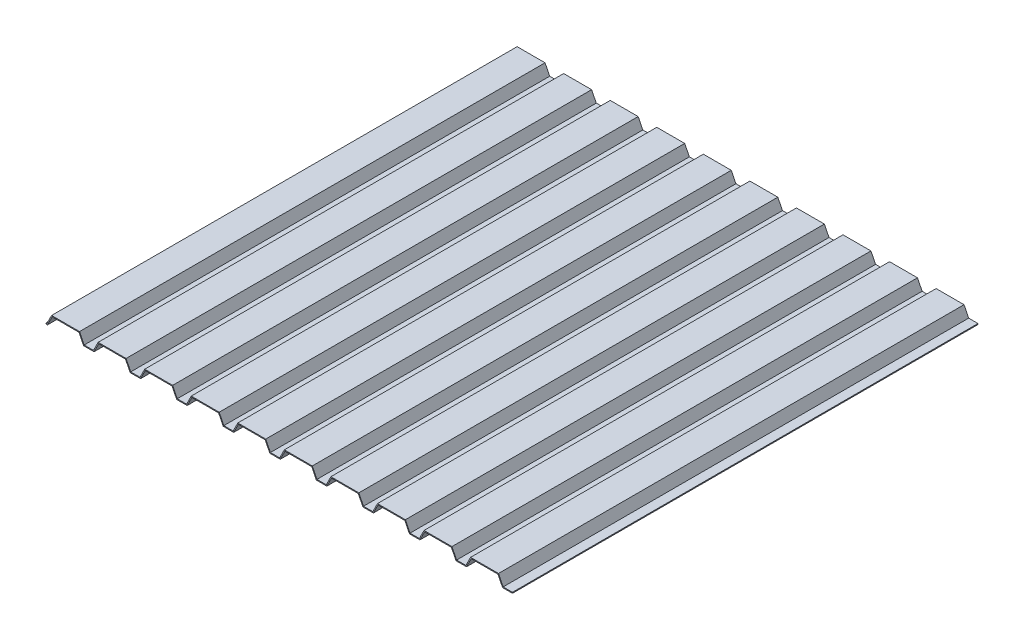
ISO-10303-21;
HEADER;
FILE_DESCRIPTION(('STEP AP214'),'2;1');
FILE_NAME('part.step','',(''),(''),'','','');
FILE_SCHEMA(('AUTOMOTIVE_DESIGN { 1 0 10303 214 1 1 1 1 }'));
ENDSEC;
DATA;
#1=APPLICATION_CONTEXT('core data for automotive mechanical design processes');
#2=APPLICATION_PROTOCOL_DEFINITION('international standard','automotive_design',2000,#1);
#3=PRODUCT_CONTEXT('',#1,'mechanical');
#4=PRODUCT('Part','Part','',(#3));
#5=PRODUCT_RELATED_PRODUCT_CATEGORY('part','',(#4));
#6=PRODUCT_DEFINITION_FORMATION('','',#4);
#7=PRODUCT_DEFINITION_CONTEXT('part definition',#1,'design');
#8=PRODUCT_DEFINITION('design','',#6,#7);
#9=PRODUCT_DEFINITION_SHAPE('','',#8);
#10=(LENGTH_UNIT() NAMED_UNIT(*) SI_UNIT(.MILLI.,.METRE.));
#11=(NAMED_UNIT(*) PLANE_ANGLE_UNIT() SI_UNIT($,.RADIAN.));
#12=(NAMED_UNIT(*) SI_UNIT($,.STERADIAN.) SOLID_ANGLE_UNIT());
#13=UNCERTAINTY_MEASURE_WITH_UNIT(LENGTH_MEASURE(1.E-05),#10,'distance_accuracy_value','');
#14=(GEOMETRIC_REPRESENTATION_CONTEXT(3) GLOBAL_UNCERTAINTY_ASSIGNED_CONTEXT((#13)) GLOBAL_UNIT_ASSIGNED_CONTEXT((#10,
#11,#12)) REPRESENTATION_CONTEXT('',''));
#15=CARTESIAN_POINT('',(0.,0.,0.));
#16=DIRECTION('',(0.,0.,1.));
#17=DIRECTION('',(1.,0.,0.));
#18=AXIS2_PLACEMENT_3D('',#15,#16,#17);
#19=CARTESIAN_POINT('',(40.,-1.,500.));
#20=DIRECTION('',(0.,1.,0.));
#21=DIRECTION('',(0.,0.,1.));
#22=AXIS2_PLACEMENT_3D('',#19,#20,#21);
#23=PLANE('',#22);
#24=DIRECTION('',(1.,0.,0.));
#25=VECTOR('',#24,1.);
#26=CARTESIAN_POINT('',(40.,-1.,0.));
#27=LINE('',#26,#25);
#28=CARTESIAN_POINT('',(39.3819660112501,-1.,0.));
#29=VERTEX_POINT('',#28);
#30=CARTESIAN_POINT('',(50.,-1.,0.));
#31=VERTEX_POINT('',#30);
#32=EDGE_CURVE('E144',#29,#31,#27,.T.);
#33=ORIENTED_EDGE('',*,*,#32,.T.);
#34=DIRECTION('',(0.,0.,-1.));
#35=VECTOR('',#34,1.);
#36=CARTESIAN_POINT('',(50.,-1.,500.));
#37=LINE('',#36,#35);
#38=CARTESIAN_POINT('',(50.,-1.,500.));
#39=VERTEX_POINT('',#38);
#40=EDGE_CURVE('E11',#39,#31,#37,.T.);
#41=ORIENTED_EDGE('',*,*,#40,.F.);
#42=DIRECTION('',(1.,0.,0.));
#43=VECTOR('',#42,1.);
#44=CARTESIAN_POINT('',(40.,-1.,500.));
#45=LINE('',#44,#43);
#46=CARTESIAN_POINT('',(39.3819660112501,-1.,500.));
#47=VERTEX_POINT('',#46);
#48=EDGE_CURVE('E94',#47,#39,#45,.T.);
#49=ORIENTED_EDGE('',*,*,#48,.F.);
#50=DIRECTION('',(0.,0.,-1.));
#51=VECTOR('',#50,1.);
#52=CARTESIAN_POINT('',(39.3819660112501,-1.,500.));
#53=LINE('',#52,#51);
#54=EDGE_CURVE('E140',#47,#29,#53,.T.);
#55=ORIENTED_EDGE('',*,*,#54,.T.);
#56=EDGE_LOOP('',(#33,#41,#49,#55));
#57=FACE_BOUND('',#56,.T.);
#58=ADVANCED_FACE('F31',(#57),#23,.F.);
#59=CARTESIAN_POINT('',(50.,0.,500.));
#60=DIRECTION('',(1.,0.,0.));
#61=DIRECTION('',(0.,0.,-1.));
#62=AXIS2_PLACEMENT_3D('',#59,#60,#61);
#63=PLANE('',#62);
#64=DIRECTION('',(0.,-1.,0.));
#65=VECTOR('',#64,1.);
#66=CARTESIAN_POINT('',(50.,0.,0.));
#67=LINE('',#66,#65);
#68=CARTESIAN_POINT('',(50.,0.,0.));
#69=VERTEX_POINT('',#68);
#70=EDGE_CURVE('E147',#69,#31,#67,.T.);
#71=ORIENTED_EDGE('',*,*,#70,.F.);
#72=DIRECTION('',(0.,0.,-1.));
#73=VECTOR('',#72,1.);
#74=CARTESIAN_POINT('',(50.,0.,500.));
#75=LINE('',#74,#73);
#76=CARTESIAN_POINT('',(50.,0.,500.));
#77=VERTEX_POINT('',#76);
#78=EDGE_CURVE('E39',#77,#69,#75,.T.);
#79=ORIENTED_EDGE('',*,*,#78,.F.);
#80=DIRECTION('',(0.,-1.,0.));
#81=VECTOR('',#80,1.);
#82=CARTESIAN_POINT('',(50.,0.,500.));
#83=LINE('',#82,#81);
#84=EDGE_CURVE('E203',#77,#39,#83,.T.);
#85=ORIENTED_EDGE('',*,*,#84,.T.);
#86=ORIENTED_EDGE('',*,*,#40,.T.);
#87=EDGE_LOOP('',(#71,#79,#85,#86));
#88=FACE_BOUND('',#87,.T.);
#89=ADVANCED_FACE('F190',(#88),#63,.T.);
#90=CARTESIAN_POINT('',(40.,0.,500.));
#91=DIRECTION('',(0.,1.,0.));
#92=DIRECTION('',(0.,0.,1.));
#93=AXIS2_PLACEMENT_3D('',#90,#91,#92);
#94=PLANE('',#93);
#95=DIRECTION('',(1.,0.,0.));
#96=VECTOR('',#95,1.);
#97=CARTESIAN_POINT('',(40.,0.,0.));
#98=LINE('',#97,#96);
#99=CARTESIAN_POINT('',(40.,0.,0.));
#100=VERTEX_POINT('',#99);
#101=EDGE_CURVE('E151',#100,#69,#98,.T.);
#102=ORIENTED_EDGE('',*,*,#101,.F.);
#103=DIRECTION('',(0.,0.,-1.));
#104=VECTOR('',#103,1.);
#105=CARTESIAN_POINT('',(40.,0.,500.));
#106=LINE('',#105,#104);
#107=CARTESIAN_POINT('',(40.,0.,500.));
#108=VERTEX_POINT('',#107);
#109=EDGE_CURVE('E180',#108,#100,#106,.T.);
#110=ORIENTED_EDGE('',*,*,#109,.F.);
#111=DIRECTION('',(1.,0.,0.));
#112=VECTOR('',#111,1.);
#113=CARTESIAN_POINT('',(40.,0.,500.));
#114=LINE('',#113,#112);
#115=EDGE_CURVE('E187',#108,#77,#114,.T.);
#116=ORIENTED_EDGE('',*,*,#115,.T.);
#117=ORIENTED_EDGE('',*,*,#78,.T.);
#118=EDGE_LOOP('',(#102,#110,#116,#117));
#119=FACE_BOUND('',#118,.T.);
#120=ADVANCED_FACE('F185',(#119),#94,.T.);
#121=CARTESIAN_POINT('',(35.,10.,500.));
#122=DIRECTION('',(0.894427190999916,0.447213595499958,0.));
#123=DIRECTION('',(-0.447213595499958,0.894427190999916,0.));
#124=AXIS2_PLACEMENT_3D('',#121,#122,#123);
#125=PLANE('',#124);
#126=DIRECTION('',(0.447213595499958,-0.894427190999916,0.));
#127=VECTOR('',#126,1.);
#128=CARTESIAN_POINT('',(35.,10.,0.));
#129=LINE('',#128,#127);
#130=CARTESIAN_POINT('',(35.,10.,0.));
#131=VERTEX_POINT('',#130);
#132=EDGE_CURVE('E154',#131,#100,#129,.T.);
#133=ORIENTED_EDGE('',*,*,#132,.F.);
#134=DIRECTION('',(0.,0.,-1.));
#135=VECTOR('',#134,1.);
#136=CARTESIAN_POINT('',(35.,10.,500.));
#137=LINE('',#136,#135);
#138=CARTESIAN_POINT('',(35.,10.,500.));
#139=VERTEX_POINT('',#138);
#140=EDGE_CURVE('E178',#139,#131,#137,.T.);
#141=ORIENTED_EDGE('',*,*,#140,.F.);
#142=DIRECTION('',(0.447213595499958,-0.894427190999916,0.));
#143=VECTOR('',#142,1.);
#144=CARTESIAN_POINT('',(35.,10.,500.));
#145=LINE('',#144,#143);
#146=EDGE_CURVE('E200',#139,#108,#145,.T.);
#147=ORIENTED_EDGE('',*,*,#146,.T.);
#148=ORIENTED_EDGE('',*,*,#109,.T.);
#149=EDGE_LOOP('',(#133,#141,#147,#148));
#150=FACE_BOUND('',#149,.T.);
#151=ADVANCED_FACE('F197',(#150),#125,.T.);
#152=CARTESIAN_POINT('',(5.,10.,500.));
#153=DIRECTION('',(0.,1.,0.));
#154=DIRECTION('',(0.,0.,1.));
#155=AXIS2_PLACEMENT_3D('',#152,#153,#154);
#156=PLANE('',#155);
#157=DIRECTION('',(1.,0.,0.));
#158=VECTOR('',#157,1.);
#159=CARTESIAN_POINT('',(5.,10.,0.));
#160=LINE('',#159,#158);
#161=CARTESIAN_POINT('',(5.,10.,0.));
#162=VERTEX_POINT('',#161);
#163=EDGE_CURVE('E157',#162,#131,#160,.T.);
#164=ORIENTED_EDGE('',*,*,#163,.F.);
#165=DIRECTION('',(0.,0.,-1.));
#166=VECTOR('',#165,1.);
#167=CARTESIAN_POINT('',(5.,10.,500.));
#168=LINE('',#167,#166);
#169=CARTESIAN_POINT('',(5.,10.,500.));
#170=VERTEX_POINT('',#169);
#171=EDGE_CURVE('E176',#170,#162,#168,.T.);
#172=ORIENTED_EDGE('',*,*,#171,.F.);
#173=DIRECTION('',(1.,0.,0.));
#174=VECTOR('',#173,1.);
#175=CARTESIAN_POINT('',(5.,10.,500.));
#176=LINE('',#175,#174);
#177=EDGE_CURVE('E205',#170,#139,#176,.T.);
#178=ORIENTED_EDGE('',*,*,#177,.T.);
#179=ORIENTED_EDGE('',*,*,#140,.T.);
#180=EDGE_LOOP('',(#164,#172,#178,#179));
#181=FACE_BOUND('',#180,.T.);
#182=ADVANCED_FACE('F421',(#181),#156,.T.);
#183=CARTESIAN_POINT('',(0.,0.,500.));
#184=DIRECTION('',(-0.894427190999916,0.447213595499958,0.));
#185=DIRECTION('',(-0.447213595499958,-0.894427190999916,0.));
#186=AXIS2_PLACEMENT_3D('',#183,#184,#185);
#187=PLANE('',#186);
#188=DIRECTION('',(0.447213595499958,0.894427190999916,0.));
#189=VECTOR('',#188,1.);
#190=CARTESIAN_POINT('',(0.,0.,0.));
#191=LINE('',#190,#189);
#192=CARTESIAN_POINT('',(0.,0.,0.));
#193=VERTEX_POINT('',#192);
#194=EDGE_CURVE('E160',#193,#162,#191,.T.);
#195=ORIENTED_EDGE('',*,*,#194,.F.);
#196=DIRECTION('',(0.,0.,-1.));
#197=VECTOR('',#196,1.);
#198=CARTESIAN_POINT('',(0.,0.,500.));
#199=LINE('',#198,#197);
#200=CARTESIAN_POINT('',(0.,0.,500.));
#201=VERTEX_POINT('',#200);
#202=EDGE_CURVE('E174',#201,#193,#199,.T.);
#203=ORIENTED_EDGE('',*,*,#202,.F.);
#204=DIRECTION('',(0.447213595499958,0.894427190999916,0.));
#205=VECTOR('',#204,1.);
#206=CARTESIAN_POINT('',(0.,0.,500.));
#207=LINE('',#206,#205);
#208=EDGE_CURVE('E211',#201,#170,#207,.T.);
#209=ORIENTED_EDGE('',*,*,#208,.T.);
#210=ORIENTED_EDGE('',*,*,#171,.T.);
#211=EDGE_LOOP('',(#195,#203,#209,#210));
#212=FACE_BOUND('',#211,.T.);
#213=ADVANCED_FACE('F424',(#212),#187,.T.);
#214=CARTESIAN_POINT('',(0.,0.,500.));
#215=DIRECTION('',(0.,1.,0.));
#216=DIRECTION('',(-1.,0.,0.));
#217=AXIS2_PLACEMENT_3D('',#214,#215,#216);
#218=PLANE('',#217);
#219=DIRECTION('',(1.,0.,0.));
#220=VECTOR('',#219,1.);
#221=CARTESIAN_POINT('',(0.,0.,0.));
#222=LINE('',#221,#220);
#223=CARTESIAN_POINT('',(-9.99999999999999,0.,0.));
#224=VERTEX_POINT('',#223);
#225=EDGE_CURVE('E163',#224,#193,#222,.T.);
#226=ORIENTED_EDGE('',*,*,#225,.F.);
#227=DIRECTION('',(0.,0.,-1.));
#228=VECTOR('',#227,1.);
#229=CARTESIAN_POINT('',(-9.99999999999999,0.,500.));
#230=LINE('',#229,#228);
#231=CARTESIAN_POINT('',(-9.99999999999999,0.,500.));
#232=VERTEX_POINT('',#231);
#233=EDGE_CURVE('E148',#232,#224,#230,.T.);
#234=ORIENTED_EDGE('',*,*,#233,.F.);
#235=DIRECTION('',(1.,0.,0.));
#236=VECTOR('',#235,1.);
#237=CARTESIAN_POINT('',(0.,0.,500.));
#238=LINE('',#237,#236);
#239=EDGE_CURVE('E214',#232,#201,#238,.T.);
#240=ORIENTED_EDGE('',*,*,#239,.T.);
#241=ORIENTED_EDGE('',*,*,#202,.T.);
#242=EDGE_LOOP('',(#226,#234,#240,#241));
#243=FACE_BOUND('',#242,.T.);
#244=ADVANCED_FACE('F220',(#243),#218,.T.);
#245=CARTESIAN_POINT('',(0.,-1.,500.));
#246=DIRECTION('',(0.,1.,0.));
#247=DIRECTION('',(-1.,0.,0.));
#248=AXIS2_PLACEMENT_3D('',#245,#246,#247);
#249=PLANE('',#248);
#250=DIRECTION('',(0.,0.,-1.));
#251=VECTOR('',#250,1.);
#252=CARTESIAN_POINT('',(0.618033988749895,-1.,500.));
#253=LINE('',#252,#251);
#254=CARTESIAN_POINT('',(0.618033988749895,-1.,500.));
#255=VERTEX_POINT('',#254);
#256=CARTESIAN_POINT('',(0.618033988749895,-1.,0.));
#257=VERTEX_POINT('',#256);
#258=EDGE_CURVE('E135',#255,#257,#253,.T.);
#259=ORIENTED_EDGE('',*,*,#258,.F.);
#260=DIRECTION('',(1.,0.,0.));
#261=VECTOR('',#260,1.);
#262=CARTESIAN_POINT('',(0.,-1.,500.));
#263=LINE('',#262,#261);
#264=CARTESIAN_POINT('',(-10.6180339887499,-1.,500.));
#265=VERTEX_POINT('',#264);
#266=EDGE_CURVE('E126',#265,#255,#263,.T.);
#267=ORIENTED_EDGE('',*,*,#266,.F.);
#268=DIRECTION('',(0.,0.,-1.));
#269=VECTOR('',#268,1.);
#270=CARTESIAN_POINT('',(-10.6180339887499,-1.,500.));
#271=LINE('',#270,#269);
#272=CARTESIAN_POINT('',(-10.6180339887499,-1.,0.));
#273=VERTEX_POINT('',#272);
#274=EDGE_CURVE('E296',#265,#273,#271,.T.);
#275=ORIENTED_EDGE('',*,*,#274,.T.);
#276=DIRECTION('',(1.,0.,0.));
#277=VECTOR('',#276,1.);
#278=CARTESIAN_POINT('',(0.,-1.,0.));
#279=LINE('',#278,#277);
#280=EDGE_CURVE('E166',#273,#257,#279,.T.);
#281=ORIENTED_EDGE('',*,*,#280,.T.);
#282=EDGE_LOOP('',(#259,#267,#275,#281));
#283=FACE_BOUND('',#282,.T.);
#284=ADVANCED_FACE('F398',(#283),#249,.F.);
#285=CARTESIAN_POINT('',(0.894427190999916,-0.447213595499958,500.));
#286=DIRECTION('',(-0.894427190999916,0.447213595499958,0.));
#287=DIRECTION('',(-0.447213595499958,-0.894427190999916,0.));
#288=AXIS2_PLACEMENT_3D('',#285,#286,#287);
#289=PLANE('',#288);
#290=DIRECTION('',(0.447213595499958,0.894427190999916,0.));
#291=VECTOR('',#290,1.);
#292=CARTESIAN_POINT('',(0.894427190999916,-0.447213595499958,0.));
#293=LINE('',#292,#291);
#294=CARTESIAN_POINT('',(5.6180339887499,9.,0.));
#295=VERTEX_POINT('',#294);
#296=EDGE_CURVE('E134',#257,#295,#293,.T.);
#297=ORIENTED_EDGE('',*,*,#296,.T.);
#298=DIRECTION('',(0.,0.,-1.));
#299=VECTOR('',#298,1.);
#300=CARTESIAN_POINT('',(5.6180339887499,9.,500.));
#301=LINE('',#300,#299);
#302=CARTESIAN_POINT('',(5.6180339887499,9.,500.));
#303=VERTEX_POINT('',#302);
#304=EDGE_CURVE('E131',#303,#295,#301,.T.);
#305=ORIENTED_EDGE('',*,*,#304,.F.);
#306=DIRECTION('',(0.447213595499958,0.894427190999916,0.));
#307=VECTOR('',#306,1.);
#308=CARTESIAN_POINT('',(0.894427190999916,-0.447213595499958,500.));
#309=LINE('',#308,#307);
#310=EDGE_CURVE('E118',#255,#303,#309,.T.);
#311=ORIENTED_EDGE('',*,*,#310,.F.);
#312=ORIENTED_EDGE('',*,*,#258,.T.);
#313=EDGE_LOOP('',(#297,#305,#311,#312));
#314=FACE_BOUND('',#313,.T.);
#315=ADVANCED_FACE('F132',(#314),#289,.F.);
#316=CARTESIAN_POINT('',(5.,9.,500.));
#317=DIRECTION('',(0.,1.,0.));
#318=DIRECTION('',(0.,0.,1.));
#319=AXIS2_PLACEMENT_3D('',#316,#317,#318);
#320=PLANE('',#319);
#321=DIRECTION('',(1.,0.,0.));
#322=VECTOR('',#321,1.);
#323=CARTESIAN_POINT('',(5.,9.,0.));
#324=LINE('',#323,#322);
#325=CARTESIAN_POINT('',(34.3819660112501,9.,0.));
#326=VERTEX_POINT('',#325);
#327=EDGE_CURVE('E82',#295,#326,#324,.T.);
#328=ORIENTED_EDGE('',*,*,#327,.T.);
#329=DIRECTION('',(0.,0.,-1.));
#330=VECTOR('',#329,1.);
#331=CARTESIAN_POINT('',(34.3819660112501,9.,500.));
#332=LINE('',#331,#330);
#333=CARTESIAN_POINT('',(34.3819660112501,9.,500.));
#334=VERTEX_POINT('',#333);
#335=EDGE_CURVE('E136',#334,#326,#332,.T.);
#336=ORIENTED_EDGE('',*,*,#335,.F.);
#337=DIRECTION('',(1.,0.,0.));
#338=VECTOR('',#337,1.);
#339=CARTESIAN_POINT('',(5.,9.,500.));
#340=LINE('',#339,#338);
#341=EDGE_CURVE('E123',#303,#334,#340,.T.);
#342=ORIENTED_EDGE('',*,*,#341,.F.);
#343=ORIENTED_EDGE('',*,*,#304,.T.);
#344=EDGE_LOOP('',(#328,#336,#342,#343));
#345=FACE_BOUND('',#344,.T.);
#346=ADVANCED_FACE('F138',(#345),#320,.F.);
#347=CARTESIAN_POINT('',(34.1055728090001,9.55278640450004,500.));
#348=DIRECTION('',(0.894427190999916,0.447213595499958,0.));
#349=DIRECTION('',(-0.447213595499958,0.894427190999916,0.));
#350=AXIS2_PLACEMENT_3D('',#347,#348,#349);
#351=PLANE('',#350);
#352=DIRECTION('',(0.447213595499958,-0.894427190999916,0.));
#353=VECTOR('',#352,1.);
#354=CARTESIAN_POINT('',(34.1055728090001,9.55278640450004,0.));
#355=LINE('',#354,#353);
#356=EDGE_CURVE('E88',#326,#29,#355,.T.);
#357=ORIENTED_EDGE('',*,*,#356,.T.);
#358=ORIENTED_EDGE('',*,*,#54,.F.);
#359=DIRECTION('',(0.447213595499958,-0.894427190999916,0.));
#360=VECTOR('',#359,1.);
#361=CARTESIAN_POINT('',(34.1055728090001,9.55278640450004,500.));
#362=LINE('',#361,#360);
#363=EDGE_CURVE('E47',#334,#47,#362,.T.);
#364=ORIENTED_EDGE('',*,*,#363,.F.);
#365=ORIENTED_EDGE('',*,*,#335,.T.);
#366=EDGE_LOOP('',(#357,#358,#364,#365));
#367=FACE_BOUND('',#366,.T.);
#368=ADVANCED_FACE('F400',(#367),#351,.F.);
#369=CARTESIAN_POINT('',(50.,-1.,500.));
#370=DIRECTION('',(0.,0.,-1.));
#371=DIRECTION('',(-1.,0.,0.));
#372=AXIS2_PLACEMENT_3D('',#369,#370,#371);
#373=PLANE('',#372);
#374=ORIENTED_EDGE('',*,*,#208,.F.);
#375=ORIENTED_EDGE('',*,*,#239,.F.);
#376=DIRECTION('',(0.447213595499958,-0.894427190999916,0.));
#377=VECTOR('',#376,1.);
#378=CARTESIAN_POINT('',(-15.,10.,500.));
#379=LINE('',#378,#377);
#380=CARTESIAN_POINT('',(-15.,10.,500.));
#381=VERTEX_POINT('',#380);
#382=EDGE_CURVE('E228',#381,#232,#379,.T.);
#383=ORIENTED_EDGE('',*,*,#382,.F.);
#384=DIRECTION('',(1.,0.,0.));
#385=VECTOR('',#384,1.);
#386=CARTESIAN_POINT('',(-45.,10.,500.));
#387=LINE('',#386,#385);
#388=CARTESIAN_POINT('',(-45.,10.,500.));
#389=VERTEX_POINT('',#388);
#390=EDGE_CURVE('E299',#389,#381,#387,.T.);
#391=ORIENTED_EDGE('',*,*,#390,.F.);
#392=DIRECTION('',(0.447213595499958,0.894427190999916,0.));
#393=VECTOR('',#392,1.);
#394=CARTESIAN_POINT('',(-50.,0.,500.));
#395=LINE('',#394,#393);
#396=CARTESIAN_POINT('',(-50.,0.,500.));
#397=VERTEX_POINT('',#396);
#398=EDGE_CURVE('E388',#397,#389,#395,.T.);
#399=ORIENTED_EDGE('',*,*,#398,.F.);
#400=DIRECTION('',(1.,0.,0.));
#401=VECTOR('',#400,1.);
#402=CARTESIAN_POINT('',(-50.,0.,500.));
#403=LINE('',#402,#401);
#404=CARTESIAN_POINT('',(-60.,0.,500.));
#405=VERTEX_POINT('',#404);
#406=EDGE_CURVE('E391',#405,#397,#403,.T.);
#407=ORIENTED_EDGE('',*,*,#406,.F.);
#408=DIRECTION('',(0.447213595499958,-0.894427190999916,0.));
#409=VECTOR('',#408,1.);
#410=CARTESIAN_POINT('',(-65.,10.,500.));
#411=LINE('',#410,#409);
#412=CARTESIAN_POINT('',(-65.,10.,500.));
#413=VERTEX_POINT('',#412);
#414=EDGE_CURVE('E359',#413,#405,#411,.T.);
#415=ORIENTED_EDGE('',*,*,#414,.F.);
#416=DIRECTION('',(1.,0.,0.));
#417=VECTOR('',#416,1.);
#418=CARTESIAN_POINT('',(-95.,10.,500.));
#419=LINE('',#418,#417);
#420=CARTESIAN_POINT('',(-95.,10.,500.));
#421=VERTEX_POINT('',#420);
#422=EDGE_CURVE('E1702',#421,#413,#419,.T.);
#423=ORIENTED_EDGE('',*,*,#422,.F.);
#424=DIRECTION('',(0.447213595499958,0.894427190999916,0.));
#425=VECTOR('',#424,1.);
#426=CARTESIAN_POINT('',(-100.,0.,500.));
#427=LINE('',#426,#425);
#428=CARTESIAN_POINT('',(-100.,0.,500.));
#429=VERTEX_POINT('',#428);
#430=EDGE_CURVE('E1705',#429,#421,#427,.T.);
#431=ORIENTED_EDGE('',*,*,#430,.F.);
#432=DIRECTION('',(1.,0.,0.));
#433=VECTOR('',#432,1.);
#434=CARTESIAN_POINT('',(-100.,0.,500.));
#435=LINE('',#434,#433);
#436=CARTESIAN_POINT('',(-110.,0.,500.));
#437=VERTEX_POINT('',#436);
#438=EDGE_CURVE('E1708',#437,#429,#435,.T.);
#439=ORIENTED_EDGE('',*,*,#438,.F.);
#440=DIRECTION('',(0.447213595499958,-0.894427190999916,0.));
#441=VECTOR('',#440,1.);
#442=CARTESIAN_POINT('',(-115.,10.,500.));
#443=LINE('',#442,#441);
#444=CARTESIAN_POINT('',(-115.,10.,500.));
#445=VERTEX_POINT('',#444);
#446=EDGE_CURVE('E1628',#445,#437,#443,.T.);
#447=ORIENTED_EDGE('',*,*,#446,.F.);
#448=DIRECTION('',(1.,0.,0.));
#449=VECTOR('',#448,1.);
#450=CARTESIAN_POINT('',(-145.,10.,500.));
#451=LINE('',#450,#449);
#452=CARTESIAN_POINT('',(-145.,10.,500.));
#453=VERTEX_POINT('',#452);
#454=EDGE_CURVE('E1631',#453,#445,#451,.T.);
#455=ORIENTED_EDGE('',*,*,#454,.F.);
#456=DIRECTION('',(0.447213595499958,0.894427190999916,0.));
#457=VECTOR('',#456,1.);
#458=CARTESIAN_POINT('',(-150.,0.,500.));
#459=LINE('',#458,#457);
#460=CARTESIAN_POINT('',(-150.,0.,500.));
#461=VERTEX_POINT('',#460);
#462=EDGE_CURVE('E1635',#461,#453,#459,.T.);
#463=ORIENTED_EDGE('',*,*,#462,.F.);
#464=DIRECTION('',(1.,0.,0.));
#465=VECTOR('',#464,1.);
#466=CARTESIAN_POINT('',(-150.,0.,500.));
#467=LINE('',#466,#465);
#468=CARTESIAN_POINT('',(-160.,0.,500.));
#469=VERTEX_POINT('',#468);
#470=EDGE_CURVE('E1638',#469,#461,#467,.T.);
#471=ORIENTED_EDGE('',*,*,#470,.F.);
#472=DIRECTION('',(0.447213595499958,-0.894427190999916,0.));
#473=VECTOR('',#472,1.);
#474=CARTESIAN_POINT('',(-165.,10.,500.));
#475=LINE('',#474,#473);
#476=CARTESIAN_POINT('',(-165.,10.,500.));
#477=VERTEX_POINT('',#476);
#478=EDGE_CURVE('E1556',#477,#469,#475,.T.);
#479=ORIENTED_EDGE('',*,*,#478,.F.);
#480=DIRECTION('',(1.,0.,0.));
#481=VECTOR('',#480,1.);
#482=CARTESIAN_POINT('',(-195.,10.,500.));
#483=LINE('',#482,#481);
#484=CARTESIAN_POINT('',(-195.,10.,500.));
#485=VERTEX_POINT('',#484);
#486=EDGE_CURVE('E1559',#485,#477,#483,.T.);
#487=ORIENTED_EDGE('',*,*,#486,.F.);
#488=DIRECTION('',(0.447213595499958,0.894427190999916,0.));
#489=VECTOR('',#488,1.);
#490=CARTESIAN_POINT('',(-200.,0.,500.));
#491=LINE('',#490,#489);
#492=CARTESIAN_POINT('',(-200.,0.,500.));
#493=VERTEX_POINT('',#492);
#494=EDGE_CURVE('E1563',#493,#485,#491,.T.);
#495=ORIENTED_EDGE('',*,*,#494,.F.);
#496=DIRECTION('',(1.,0.,0.));
#497=VECTOR('',#496,1.);
#498=CARTESIAN_POINT('',(-200.,0.,500.));
#499=LINE('',#498,#497);
#500=CARTESIAN_POINT('',(-210.,0.,500.));
#501=VERTEX_POINT('',#500);
#502=EDGE_CURVE('E1566',#501,#493,#499,.T.);
#503=ORIENTED_EDGE('',*,*,#502,.F.);
#504=DIRECTION('',(0.447213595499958,-0.894427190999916,0.));
#505=VECTOR('',#504,1.);
#506=CARTESIAN_POINT('',(-215.,10.,500.));
#507=LINE('',#506,#505);
#508=CARTESIAN_POINT('',(-215.,10.,500.));
#509=VERTEX_POINT('',#508);
#510=EDGE_CURVE('E1484',#509,#501,#507,.T.);
#511=ORIENTED_EDGE('',*,*,#510,.F.);
#512=DIRECTION('',(1.,0.,0.));
#513=VECTOR('',#512,1.);
#514=CARTESIAN_POINT('',(-245.,10.,500.));
#515=LINE('',#514,#513);
#516=CARTESIAN_POINT('',(-245.,10.,500.));
#517=VERTEX_POINT('',#516);
#518=EDGE_CURVE('E1487',#517,#509,#515,.T.);
#519=ORIENTED_EDGE('',*,*,#518,.F.);
#520=DIRECTION('',(0.447213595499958,0.894427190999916,0.));
#521=VECTOR('',#520,1.);
#522=CARTESIAN_POINT('',(-250.,0.,500.));
#523=LINE('',#522,#521);
#524=CARTESIAN_POINT('',(-250.,0.,500.));
#525=VERTEX_POINT('',#524);
#526=EDGE_CURVE('E1491',#525,#517,#523,.T.);
#527=ORIENTED_EDGE('',*,*,#526,.F.);
#528=DIRECTION('',(1.,0.,0.));
#529=VECTOR('',#528,1.);
#530=CARTESIAN_POINT('',(-250.,0.,500.));
#531=LINE('',#530,#529);
#532=CARTESIAN_POINT('',(-260.,0.,500.));
#533=VERTEX_POINT('',#532);
#534=EDGE_CURVE('E1494',#533,#525,#531,.T.);
#535=ORIENTED_EDGE('',*,*,#534,.F.);
#536=DIRECTION('',(0.447213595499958,-0.894427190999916,0.));
#537=VECTOR('',#536,1.);
#538=CARTESIAN_POINT('',(-265.,10.,500.));
#539=LINE('',#538,#537);
#540=CARTESIAN_POINT('',(-265.,10.,500.));
#541=VERTEX_POINT('',#540);
#542=EDGE_CURVE('E1412',#541,#533,#539,.T.);
#543=ORIENTED_EDGE('',*,*,#542,.F.);
#544=DIRECTION('',(1.,0.,0.));
#545=VECTOR('',#544,1.);
#546=CARTESIAN_POINT('',(-295.,10.,500.));
#547=LINE('',#546,#545);
#548=CARTESIAN_POINT('',(-295.,10.,500.));
#549=VERTEX_POINT('',#548);
#550=EDGE_CURVE('E1415',#549,#541,#547,.T.);
#551=ORIENTED_EDGE('',*,*,#550,.F.);
#552=DIRECTION('',(0.447213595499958,0.894427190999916,0.));
#553=VECTOR('',#552,1.);
#554=CARTESIAN_POINT('',(-300.,0.,500.));
#555=LINE('',#554,#553);
#556=CARTESIAN_POINT('',(-300.,0.,500.));
#557=VERTEX_POINT('',#556);
#558=EDGE_CURVE('E1419',#557,#549,#555,.T.);
#559=ORIENTED_EDGE('',*,*,#558,.F.);
#560=DIRECTION('',(1.,0.,0.));
#561=VECTOR('',#560,1.);
#562=CARTESIAN_POINT('',(-300.,0.,500.));
#563=LINE('',#562,#561);
#564=CARTESIAN_POINT('',(-310.,0.,500.));
#565=VERTEX_POINT('',#564);
#566=EDGE_CURVE('E1422',#565,#557,#563,.T.);
#567=ORIENTED_EDGE('',*,*,#566,.F.);
#568=DIRECTION('',(0.447213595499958,-0.894427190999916,0.));
#569=VECTOR('',#568,1.);
#570=CARTESIAN_POINT('',(-315.,10.,500.));
#571=LINE('',#570,#569);
#572=CARTESIAN_POINT('',(-315.,10.,500.));
#573=VERTEX_POINT('',#572);
#574=EDGE_CURVE('E1340',#573,#565,#571,.T.);
#575=ORIENTED_EDGE('',*,*,#574,.F.);
#576=DIRECTION('',(1.,0.,0.));
#577=VECTOR('',#576,1.);
#578=CARTESIAN_POINT('',(-345.,10.,500.));
#579=LINE('',#578,#577);
#580=CARTESIAN_POINT('',(-345.,10.,500.));
#581=VERTEX_POINT('',#580);
#582=EDGE_CURVE('E1343',#581,#573,#579,.T.);
#583=ORIENTED_EDGE('',*,*,#582,.F.);
#584=DIRECTION('',(0.447213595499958,0.894427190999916,0.));
#585=VECTOR('',#584,1.);
#586=CARTESIAN_POINT('',(-350.,0.,500.));
#587=LINE('',#586,#585);
#588=CARTESIAN_POINT('',(-350.,0.,500.));
#589=VERTEX_POINT('',#588);
#590=EDGE_CURVE('E1347',#589,#581,#587,.T.);
#591=ORIENTED_EDGE('',*,*,#590,.F.);
#592=DIRECTION('',(1.,0.,0.));
#593=VECTOR('',#592,1.);
#594=CARTESIAN_POINT('',(-350.,0.,500.));
#595=LINE('',#594,#593);
#596=CARTESIAN_POINT('',(-360.,0.,500.));
#597=VERTEX_POINT('',#596);
#598=EDGE_CURVE('E1350',#597,#589,#595,.T.);
#599=ORIENTED_EDGE('',*,*,#598,.F.);
#600=DIRECTION('',(0.447213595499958,-0.894427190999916,0.));
#601=VECTOR('',#600,1.);
#602=CARTESIAN_POINT('',(-365.,10.,500.));
#603=LINE('',#602,#601);
#604=CARTESIAN_POINT('',(-365.,10.,500.));
#605=VERTEX_POINT('',#604);
#606=EDGE_CURVE('E1273',#605,#597,#603,.T.);
#607=ORIENTED_EDGE('',*,*,#606,.F.);
#608=DIRECTION('',(1.,0.,0.));
#609=VECTOR('',#608,1.);
#610=CARTESIAN_POINT('',(-395.,10.,500.));
#611=LINE('',#610,#609);
#612=CARTESIAN_POINT('',(-395.,10.,500.));
#613=VERTEX_POINT('',#612);
#614=EDGE_CURVE('E1276',#613,#605,#611,.T.);
#615=ORIENTED_EDGE('',*,*,#614,.F.);
#616=DIRECTION('',(0.447213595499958,0.894427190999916,0.));
#617=VECTOR('',#616,1.);
#618=CARTESIAN_POINT('',(-400.,0.,500.));
#619=LINE('',#618,#617);
#620=CARTESIAN_POINT('',(-400.,0.,500.));
#621=VERTEX_POINT('',#620);
#622=EDGE_CURVE('E1280',#621,#613,#619,.T.);
#623=ORIENTED_EDGE('',*,*,#622,.F.);
#624=DIRECTION('',(1.,0.,0.));
#625=VECTOR('',#624,1.);
#626=CARTESIAN_POINT('',(-400.,0.,500.));
#627=LINE('',#626,#625);
#628=CARTESIAN_POINT('',(-410.,0.,500.));
#629=VERTEX_POINT('',#628);
#630=EDGE_CURVE('E1283',#629,#621,#627,.T.);
#631=ORIENTED_EDGE('',*,*,#630,.F.);
#632=DIRECTION('',(0.447213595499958,-0.894427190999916,0.));
#633=VECTOR('',#632,1.);
#634=CARTESIAN_POINT('',(-415.,10.,500.));
#635=LINE('',#634,#633);
#636=CARTESIAN_POINT('',(-415.,10.,500.));
#637=VERTEX_POINT('',#636);
#638=EDGE_CURVE('E1229',#637,#629,#635,.T.);
#639=ORIENTED_EDGE('',*,*,#638,.F.);
#640=DIRECTION('',(1.,0.,0.));
#641=VECTOR('',#640,1.);
#642=CARTESIAN_POINT('',(-445.,10.,500.));
#643=LINE('',#642,#641);
#644=CARTESIAN_POINT('',(-445.,10.,500.));
#645=VERTEX_POINT('',#644);
#646=EDGE_CURVE('E2060',#645,#637,#643,.T.);
#647=ORIENTED_EDGE('',*,*,#646,.F.);
#648=DIRECTION('',(0.447213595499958,0.894427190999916,0.));
#649=VECTOR('',#648,1.);
#650=CARTESIAN_POINT('',(-450.,0.,500.));
#651=LINE('',#650,#649);
#652=CARTESIAN_POINT('',(-450.,0.,500.));
#653=VERTEX_POINT('',#652);
#654=EDGE_CURVE('E2062',#653,#645,#651,.T.);
#655=ORIENTED_EDGE('',*,*,#654,.F.);
#656=DIRECTION('',(1.,0.,0.));
#657=VECTOR('',#656,1.);
#658=CARTESIAN_POINT('',(-450.,0.,500.));
#659=LINE('',#658,#657);
#660=CARTESIAN_POINT('',(-451.,0.,500.));
#661=VERTEX_POINT('',#660);
#662=EDGE_CURVE('E2067',#661,#653,#659,.T.);
#663=ORIENTED_EDGE('',*,*,#662,.F.);
#664=DIRECTION('',(0.,1.,0.));
#665=VECTOR('',#664,1.);
#666=CARTESIAN_POINT('',(-451.,-1.,500.));
#667=LINE('',#666,#665);
#668=CARTESIAN_POINT('',(-451.,-1.,500.));
#669=VERTEX_POINT('',#668);
#670=EDGE_CURVE('E2070',#669,#661,#667,.T.);
#671=ORIENTED_EDGE('',*,*,#670,.F.);
#672=DIRECTION('',(1.,0.,0.));
#673=VECTOR('',#672,1.);
#674=CARTESIAN_POINT('',(-450.,-1.,500.));
#675=LINE('',#674,#673);
#676=CARTESIAN_POINT('',(-449.38196601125,-1.,500.));
#677=VERTEX_POINT('',#676);
#678=EDGE_CURVE('E2073',#669,#677,#675,.T.);
#679=ORIENTED_EDGE('',*,*,#678,.T.);
#680=DIRECTION('',(0.447213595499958,0.894427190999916,0.));
#681=VECTOR('',#680,1.);
#682=CARTESIAN_POINT('',(-449.105572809,-0.447213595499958,500.));
#683=LINE('',#682,#681);
#684=CARTESIAN_POINT('',(-444.38196601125,9.,500.));
#685=VERTEX_POINT('',#684);
#686=EDGE_CURVE('E2075',#677,#685,#683,.T.);
#687=ORIENTED_EDGE('',*,*,#686,.T.);
#688=DIRECTION('',(1.,0.,0.));
#689=VECTOR('',#688,1.);
#690=CARTESIAN_POINT('',(-445.,9.,500.));
#691=LINE('',#690,#689);
#692=CARTESIAN_POINT('',(-415.61803398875,9.,500.));
#693=VERTEX_POINT('',#692);
#694=EDGE_CURVE('E1245',#685,#693,#691,.T.);
#695=ORIENTED_EDGE('',*,*,#694,.T.);
#696=DIRECTION('',(0.447213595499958,-0.894427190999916,0.));
#697=VECTOR('',#696,1.);
#698=CARTESIAN_POINT('',(-415.894427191,9.55278640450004,500.));
#699=LINE('',#698,#697);
#700=CARTESIAN_POINT('',(-410.61803398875,-1.,500.));
#701=VERTEX_POINT('',#700);
#702=EDGE_CURVE('E1241',#693,#701,#699,.T.);
#703=ORIENTED_EDGE('',*,*,#702,.T.);
#704=DIRECTION('',(1.,0.,0.));
#705=VECTOR('',#704,1.);
#706=CARTESIAN_POINT('',(-400.,-1.,500.));
#707=LINE('',#706,#705);
#708=CARTESIAN_POINT('',(-399.38196601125,-1.,500.));
#709=VERTEX_POINT('',#708);
#710=EDGE_CURVE('E1239',#701,#709,#707,.T.);
#711=ORIENTED_EDGE('',*,*,#710,.T.);
#712=DIRECTION('',(0.447213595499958,0.894427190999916,0.));
#713=VECTOR('',#712,1.);
#714=CARTESIAN_POINT('',(-399.105572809,-0.447213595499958,500.));
#715=LINE('',#714,#713);
#716=CARTESIAN_POINT('',(-394.38196601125,9.,500.));
#717=VERTEX_POINT('',#716);
#718=EDGE_CURVE('E1287',#709,#717,#715,.T.);
#719=ORIENTED_EDGE('',*,*,#718,.T.);
#720=DIRECTION('',(1.,0.,0.));
#721=VECTOR('',#720,1.);
#722=CARTESIAN_POINT('',(-395.,9.,500.));
#723=LINE('',#722,#721);
#724=CARTESIAN_POINT('',(-365.61803398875,9.,500.));
#725=VERTEX_POINT('',#724);
#726=EDGE_CURVE('E1290',#717,#725,#723,.T.);
#727=ORIENTED_EDGE('',*,*,#726,.T.);
#728=DIRECTION('',(0.447213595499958,-0.894427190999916,0.));
#729=VECTOR('',#728,1.);
#730=CARTESIAN_POINT('',(-365.894427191,9.55278640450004,500.));
#731=LINE('',#730,#729);
#732=CARTESIAN_POINT('',(-360.61803398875,-1.,500.));
#733=VERTEX_POINT('',#732);
#734=EDGE_CURVE('E1293',#725,#733,#731,.T.);
#735=ORIENTED_EDGE('',*,*,#734,.T.);
#736=DIRECTION('',(1.,0.,0.));
#737=VECTOR('',#736,1.);
#738=CARTESIAN_POINT('',(-350.,-1.,500.));
#739=LINE('',#738,#737);
#740=CARTESIAN_POINT('',(-349.38196601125,-1.,500.));
#741=VERTEX_POINT('',#740);
#742=EDGE_CURVE('E1353',#733,#741,#739,.T.);
#743=ORIENTED_EDGE('',*,*,#742,.T.);
#744=DIRECTION('',(0.447213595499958,0.894427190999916,0.));
#745=VECTOR('',#744,1.);
#746=CARTESIAN_POINT('',(-349.105572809,-0.447213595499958,500.));
#747=LINE('',#746,#745);
#748=CARTESIAN_POINT('',(-344.38196601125,9.,500.));
#749=VERTEX_POINT('',#748);
#750=EDGE_CURVE('E1356',#741,#749,#747,.T.);
#751=ORIENTED_EDGE('',*,*,#750,.T.);
#752=DIRECTION('',(1.,0.,0.));
#753=VECTOR('',#752,1.);
#754=CARTESIAN_POINT('',(-345.,9.,500.));
#755=LINE('',#754,#753);
#756=CARTESIAN_POINT('',(-315.61803398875,9.,500.));
#757=VERTEX_POINT('',#756);
#758=EDGE_CURVE('E1359',#749,#757,#755,.T.);
#759=ORIENTED_EDGE('',*,*,#758,.T.);
#760=DIRECTION('',(0.447213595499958,-0.894427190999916,0.));
#761=VECTOR('',#760,1.);
#762=CARTESIAN_POINT('',(-315.894427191,9.55278640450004,500.));
#763=LINE('',#762,#761);
#764=CARTESIAN_POINT('',(-310.61803398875,-1.,500.));
#765=VERTEX_POINT('',#764);
#766=EDGE_CURVE('E1362',#757,#765,#763,.T.);
#767=ORIENTED_EDGE('',*,*,#766,.T.);
#768=DIRECTION('',(1.,0.,0.));
#769=VECTOR('',#768,1.);
#770=CARTESIAN_POINT('',(-300.,-1.,500.));
#771=LINE('',#770,#769);
#772=CARTESIAN_POINT('',(-299.38196601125,-1.,500.));
#773=VERTEX_POINT('',#772);
#774=EDGE_CURVE('E1425',#765,#773,#771,.T.);
#775=ORIENTED_EDGE('',*,*,#774,.T.);
#776=DIRECTION('',(0.447213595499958,0.894427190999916,0.));
#777=VECTOR('',#776,1.);
#778=CARTESIAN_POINT('',(-299.105572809,-0.447213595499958,500.));
#779=LINE('',#778,#777);
#780=CARTESIAN_POINT('',(-294.38196601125,9.,500.));
#781=VERTEX_POINT('',#780);
#782=EDGE_CURVE('E1428',#773,#781,#779,.T.);
#783=ORIENTED_EDGE('',*,*,#782,.T.);
#784=DIRECTION('',(1.,0.,0.));
#785=VECTOR('',#784,1.);
#786=CARTESIAN_POINT('',(-295.,9.,500.));
#787=LINE('',#786,#785);
#788=CARTESIAN_POINT('',(-265.61803398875,9.,500.));
#789=VERTEX_POINT('',#788);
#790=EDGE_CURVE('E1431',#781,#789,#787,.T.);
#791=ORIENTED_EDGE('',*,*,#790,.T.);
#792=DIRECTION('',(0.447213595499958,-0.894427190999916,0.));
#793=VECTOR('',#792,1.);
#794=CARTESIAN_POINT('',(-265.894427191,9.55278640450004,500.));
#795=LINE('',#794,#793);
#796=CARTESIAN_POINT('',(-260.61803398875,-1.,500.));
#797=VERTEX_POINT('',#796);
#798=EDGE_CURVE('E1434',#789,#797,#795,.T.);
#799=ORIENTED_EDGE('',*,*,#798,.T.);
#800=DIRECTION('',(1.,0.,0.));
#801=VECTOR('',#800,1.);
#802=CARTESIAN_POINT('',(-250.,-1.,500.));
#803=LINE('',#802,#801);
#804=CARTESIAN_POINT('',(-249.38196601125,-1.,500.));
#805=VERTEX_POINT('',#804);
#806=EDGE_CURVE('E1497',#797,#805,#803,.T.);
#807=ORIENTED_EDGE('',*,*,#806,.T.);
#808=DIRECTION('',(0.447213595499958,0.894427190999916,0.));
#809=VECTOR('',#808,1.);
#810=CARTESIAN_POINT('',(-249.105572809,-0.447213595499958,500.));
#811=LINE('',#810,#809);
#812=CARTESIAN_POINT('',(-244.38196601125,9.,500.));
#813=VERTEX_POINT('',#812);
#814=EDGE_CURVE('E1500',#805,#813,#811,.T.);
#815=ORIENTED_EDGE('',*,*,#814,.T.);
#816=DIRECTION('',(1.,0.,0.));
#817=VECTOR('',#816,1.);
#818=CARTESIAN_POINT('',(-245.,9.,500.));
#819=LINE('',#818,#817);
#820=CARTESIAN_POINT('',(-215.61803398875,9.,500.));
#821=VERTEX_POINT('',#820);
#822=EDGE_CURVE('E1503',#813,#821,#819,.T.);
#823=ORIENTED_EDGE('',*,*,#822,.T.);
#824=DIRECTION('',(0.447213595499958,-0.894427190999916,0.));
#825=VECTOR('',#824,1.);
#826=CARTESIAN_POINT('',(-215.894427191,9.55278640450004,500.));
#827=LINE('',#826,#825);
#828=CARTESIAN_POINT('',(-210.61803398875,-1.,500.));
#829=VERTEX_POINT('',#828);
#830=EDGE_CURVE('E1506',#821,#829,#827,.T.);
#831=ORIENTED_EDGE('',*,*,#830,.T.);
#832=DIRECTION('',(1.,0.,0.));
#833=VECTOR('',#832,1.);
#834=CARTESIAN_POINT('',(-200.,-1.,500.));
#835=LINE('',#834,#833);
#836=CARTESIAN_POINT('',(-199.38196601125,-1.,500.));
#837=VERTEX_POINT('',#836);
#838=EDGE_CURVE('E1569',#829,#837,#835,.T.);
#839=ORIENTED_EDGE('',*,*,#838,.T.);
#840=DIRECTION('',(0.447213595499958,0.894427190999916,0.));
#841=VECTOR('',#840,1.);
#842=CARTESIAN_POINT('',(-199.105572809,-0.447213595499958,500.));
#843=LINE('',#842,#841);
#844=CARTESIAN_POINT('',(-194.38196601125,9.,500.));
#845=VERTEX_POINT('',#844);
#846=EDGE_CURVE('E1572',#837,#845,#843,.T.);
#847=ORIENTED_EDGE('',*,*,#846,.T.);
#848=DIRECTION('',(1.,0.,0.));
#849=VECTOR('',#848,1.);
#850=CARTESIAN_POINT('',(-195.,9.,500.));
#851=LINE('',#850,#849);
#852=CARTESIAN_POINT('',(-165.61803398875,9.,500.));
#853=VERTEX_POINT('',#852);
#854=EDGE_CURVE('E1575',#845,#853,#851,.T.);
#855=ORIENTED_EDGE('',*,*,#854,.T.);
#856=DIRECTION('',(0.447213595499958,-0.894427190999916,0.));
#857=VECTOR('',#856,1.);
#858=CARTESIAN_POINT('',(-165.894427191,9.55278640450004,500.));
#859=LINE('',#858,#857);
#860=CARTESIAN_POINT('',(-160.61803398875,-1.,500.));
#861=VERTEX_POINT('',#860);
#862=EDGE_CURVE('E1578',#853,#861,#859,.T.);
#863=ORIENTED_EDGE('',*,*,#862,.T.);
#864=DIRECTION('',(1.,0.,0.));
#865=VECTOR('',#864,1.);
#866=CARTESIAN_POINT('',(-150.,-1.,500.));
#867=LINE('',#866,#865);
#868=CARTESIAN_POINT('',(-149.38196601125,-1.,500.));
#869=VERTEX_POINT('',#868);
#870=EDGE_CURVE('E1641',#861,#869,#867,.T.);
#871=ORIENTED_EDGE('',*,*,#870,.T.);
#872=DIRECTION('',(0.447213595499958,0.894427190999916,0.));
#873=VECTOR('',#872,1.);
#874=CARTESIAN_POINT('',(-149.105572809,-0.447213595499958,500.));
#875=LINE('',#874,#873);
#876=CARTESIAN_POINT('',(-144.38196601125,9.,500.));
#877=VERTEX_POINT('',#876);
#878=EDGE_CURVE('E1644',#869,#877,#875,.T.);
#879=ORIENTED_EDGE('',*,*,#878,.T.);
#880=DIRECTION('',(1.,0.,0.));
#881=VECTOR('',#880,1.);
#882=CARTESIAN_POINT('',(-145.,9.,500.));
#883=LINE('',#882,#881);
#884=CARTESIAN_POINT('',(-115.61803398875,9.,500.));
#885=VERTEX_POINT('',#884);
#886=EDGE_CURVE('E1647',#877,#885,#883,.T.);
#887=ORIENTED_EDGE('',*,*,#886,.T.);
#888=DIRECTION('',(0.447213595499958,-0.894427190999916,0.));
#889=VECTOR('',#888,1.);
#890=CARTESIAN_POINT('',(-115.894427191,9.55278640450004,500.));
#891=LINE('',#890,#889);
#892=CARTESIAN_POINT('',(-110.61803398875,-1.,500.));
#893=VERTEX_POINT('',#892);
#894=EDGE_CURVE('E1650',#885,#893,#891,.T.);
#895=ORIENTED_EDGE('',*,*,#894,.T.);
#896=DIRECTION('',(1.,0.,0.));
#897=VECTOR('',#896,1.);
#898=CARTESIAN_POINT('',(-100.,-1.,500.));
#899=LINE('',#898,#897);
#900=CARTESIAN_POINT('',(-99.3819660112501,-1.,500.));
#901=VERTEX_POINT('',#900);
#902=EDGE_CURVE('E1711',#893,#901,#899,.T.);
#903=ORIENTED_EDGE('',*,*,#902,.T.);
#904=DIRECTION('',(0.447213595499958,0.894427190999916,0.));
#905=VECTOR('',#904,1.);
#906=CARTESIAN_POINT('',(-99.1055728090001,-0.447213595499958,500.));
#907=LINE('',#906,#905);
#908=CARTESIAN_POINT('',(-94.3819660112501,9.,500.));
#909=VERTEX_POINT('',#908);
#910=EDGE_CURVE('E1714',#901,#909,#907,.T.);
#911=ORIENTED_EDGE('',*,*,#910,.T.);
#912=DIRECTION('',(1.,0.,0.));
#913=VECTOR('',#912,1.);
#914=CARTESIAN_POINT('',(-95.,9.,500.));
#915=LINE('',#914,#913);
#916=CARTESIAN_POINT('',(-65.6180339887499,9.,500.));
#917=VERTEX_POINT('',#916);
#918=EDGE_CURVE('E370',#909,#917,#915,.T.);
#919=ORIENTED_EDGE('',*,*,#918,.T.);
#920=DIRECTION('',(0.447213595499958,-0.894427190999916,0.));
#921=VECTOR('',#920,1.);
#922=CARTESIAN_POINT('',(-65.8944271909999,9.55278640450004,500.));
#923=LINE('',#922,#921);
#924=CARTESIAN_POINT('',(-60.6180339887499,-1.,500.));
#925=VERTEX_POINT('',#924);
#926=EDGE_CURVE('E366',#917,#925,#923,.T.);
#927=ORIENTED_EDGE('',*,*,#926,.T.);
#928=DIRECTION('',(1.,0.,0.));
#929=VECTOR('',#928,1.);
#930=CARTESIAN_POINT('',(-50.,-1.,500.));
#931=LINE('',#930,#929);
#932=CARTESIAN_POINT('',(-49.3819660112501,-1.,500.));
#933=VERTEX_POINT('',#932);
#934=EDGE_CURVE('E364',#925,#933,#931,.T.);
#935=ORIENTED_EDGE('',*,*,#934,.T.);
#936=DIRECTION('',(0.447213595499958,0.894427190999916,0.));
#937=VECTOR('',#936,1.);
#938=CARTESIAN_POINT('',(-49.1055728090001,-0.447213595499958,500.));
#939=LINE('',#938,#937);
#940=CARTESIAN_POINT('',(-44.3819660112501,9.,500.));
#941=VERTEX_POINT('',#940);
#942=EDGE_CURVE('E395',#933,#941,#939,.T.);
#943=ORIENTED_EDGE('',*,*,#942,.T.);
#944=DIRECTION('',(1.,0.,0.));
#945=VECTOR('',#944,1.);
#946=CARTESIAN_POINT('',(-45.,9.,500.));
#947=LINE('',#946,#945);
#948=CARTESIAN_POINT('',(-15.6180339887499,9.,500.));
#949=VERTEX_POINT('',#948);
#950=EDGE_CURVE('E396',#941,#949,#947,.T.);
#951=ORIENTED_EDGE('',*,*,#950,.T.);
#952=DIRECTION('',(0.447213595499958,-0.894427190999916,0.));
#953=VECTOR('',#952,1.);
#954=CARTESIAN_POINT('',(-15.8944271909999,9.55278640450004,500.));
#955=LINE('',#954,#953);
#956=EDGE_CURVE('E295',#949,#265,#955,.T.);
#957=ORIENTED_EDGE('',*,*,#956,.T.);
#958=ORIENTED_EDGE('',*,*,#266,.T.);
#959=ORIENTED_EDGE('',*,*,#310,.T.);
#960=ORIENTED_EDGE('',*,*,#341,.T.);
#961=ORIENTED_EDGE('',*,*,#363,.T.);
#962=ORIENTED_EDGE('',*,*,#48,.T.);
#963=ORIENTED_EDGE('',*,*,#84,.F.);
#964=ORIENTED_EDGE('',*,*,#115,.F.);
#965=ORIENTED_EDGE('',*,*,#146,.F.);
#966=ORIENTED_EDGE('',*,*,#177,.F.);
#967=EDGE_LOOP('',(#374,#375,#383,#391,#399,#407,#415,#423,#431,#439,#447,#455,#463,#471,#479,
#487,#495,#503,#511,#519,#527,#535,#543,#551,#559,#567,#575,#583,#591,#599,#607,#615,#623,#631,
#639,#647,#655,#663,#671,#679,#687,#695,#703,#711,#719,#727,#735,#743,#751,#759,#767,#775,#783,
#791,#799,#807,#815,#823,#831,#839,#847,#855,#863,#871,#879,#887,#895,#903,#911,#919,#927,#935,
#943,#951,#957,#958,#959,#960,#961,#962,#963,#964,#965,#966));
#968=FACE_BOUND('',#967,.T.);
#969=ADVANCED_FACE('F121',(#968),#373,.F.);
#970=CARTESIAN_POINT('',(50.,-1.,0.));
#971=DIRECTION('',(0.,0.,-1.));
#972=DIRECTION('',(-1.,0.,0.));
#973=AXIS2_PLACEMENT_3D('',#970,#971,#972);
#974=PLANE('',#973);
#975=ORIENTED_EDGE('',*,*,#296,.F.);
#976=ORIENTED_EDGE('',*,*,#280,.F.);
#977=DIRECTION('',(0.447213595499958,-0.894427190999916,0.));
#978=VECTOR('',#977,1.);
#979=CARTESIAN_POINT('',(-15.8944271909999,9.55278640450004,0.));
#980=LINE('',#979,#978);
#981=CARTESIAN_POINT('',(-15.6180339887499,9.,0.));
#982=VERTEX_POINT('',#981);
#983=EDGE_CURVE('E287',#982,#273,#980,.T.);
#984=ORIENTED_EDGE('',*,*,#983,.F.);
#985=DIRECTION('',(1.,0.,0.));
#986=VECTOR('',#985,1.);
#987=CARTESIAN_POINT('',(-45.,9.,0.));
#988=LINE('',#987,#986);
#989=CARTESIAN_POINT('',(-44.3819660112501,9.,0.));
#990=VERTEX_POINT('',#989);
#991=EDGE_CURVE('E277',#990,#982,#988,.T.);
#992=ORIENTED_EDGE('',*,*,#991,.F.);
#993=DIRECTION('',(0.447213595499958,0.894427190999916,0.));
#994=VECTOR('',#993,1.);
#995=CARTESIAN_POINT('',(-49.1055728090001,-0.447213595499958,0.));
#996=LINE('',#995,#994);
#997=CARTESIAN_POINT('',(-49.3819660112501,-1.,0.));
#998=VERTEX_POINT('',#997);
#999=EDGE_CURVE('E288',#998,#990,#996,.T.);
#1000=ORIENTED_EDGE('',*,*,#999,.F.);
#1001=DIRECTION('',(1.,0.,0.));
#1002=VECTOR('',#1001,1.);
#1003=CARTESIAN_POINT('',(-50.,-1.,0.));
#1004=LINE('',#1003,#1002);
#1005=CARTESIAN_POINT('',(-60.6180339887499,-1.,0.));
#1006=VERTEX_POINT('',#1005);
#1007=EDGE_CURVE('E337',#1006,#998,#1004,.T.);
#1008=ORIENTED_EDGE('',*,*,#1007,.F.);
#1009=DIRECTION('',(0.447213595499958,-0.894427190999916,0.));
#1010=VECTOR('',#1009,1.);
#1011=CARTESIAN_POINT('',(-65.8944271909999,9.55278640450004,0.));
#1012=LINE('',#1011,#1010);
#1013=CARTESIAN_POINT('',(-65.6180339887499,9.,0.));
#1014=VERTEX_POINT('',#1013);
#1015=EDGE_CURVE('E347',#1014,#1006,#1012,.T.);
#1016=ORIENTED_EDGE('',*,*,#1015,.F.);
#1017=DIRECTION('',(1.,0.,0.));
#1018=VECTOR('',#1017,1.);
#1019=CARTESIAN_POINT('',(-95.,9.,0.));
#1020=LINE('',#1019,#1018);
#1021=CARTESIAN_POINT('',(-94.3819660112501,9.,0.));
#1022=VERTEX_POINT('',#1021);
#1023=EDGE_CURVE('E360',#1022,#1014,#1020,.T.);
#1024=ORIENTED_EDGE('',*,*,#1023,.F.);
#1025=DIRECTION('',(0.447213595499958,0.894427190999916,0.));
#1026=VECTOR('',#1025,1.);
#1027=CARTESIAN_POINT('',(-99.1055728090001,-0.447213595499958,0.));
#1028=LINE('',#1027,#1026);
#1029=CARTESIAN_POINT('',(-99.3819660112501,-1.,0.));
#1030=VERTEX_POINT('',#1029);
#1031=EDGE_CURVE('E1733',#1030,#1022,#1028,.T.);
#1032=ORIENTED_EDGE('',*,*,#1031,.F.);
#1033=DIRECTION('',(1.,0.,0.));
#1034=VECTOR('',#1033,1.);
#1035=CARTESIAN_POINT('',(-100.,-1.,0.));
#1036=LINE('',#1035,#1034);
#1037=CARTESIAN_POINT('',(-110.61803398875,-1.,0.));
#1038=VERTEX_POINT('',#1037);
#1039=EDGE_CURVE('E1730',#1038,#1030,#1036,.T.);
#1040=ORIENTED_EDGE('',*,*,#1039,.F.);
#1041=DIRECTION('',(0.447213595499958,-0.894427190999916,0.));
#1042=VECTOR('',#1041,1.);
#1043=CARTESIAN_POINT('',(-115.894427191,9.55278640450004,0.));
#1044=LINE('',#1043,#1042);
#1045=CARTESIAN_POINT('',(-115.61803398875,9.,0.));
#1046=VERTEX_POINT('',#1045);
#1047=EDGE_CURVE('E1632',#1046,#1038,#1044,.T.);
#1048=ORIENTED_EDGE('',*,*,#1047,.F.);
#1049=DIRECTION('',(1.,0.,0.));
#1050=VECTOR('',#1049,1.);
#1051=CARTESIAN_POINT('',(-145.,9.,0.));
#1052=LINE('',#1051,#1050);
#1053=CARTESIAN_POINT('',(-144.38196601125,9.,0.));
#1054=VERTEX_POINT('',#1053);
#1055=EDGE_CURVE('E1671',#1054,#1046,#1052,.T.);
#1056=ORIENTED_EDGE('',*,*,#1055,.F.);
#1057=DIRECTION('',(0.447213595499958,0.894427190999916,0.));
#1058=VECTOR('',#1057,1.);
#1059=CARTESIAN_POINT('',(-149.105572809,-0.447213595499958,0.));
#1060=LINE('',#1059,#1058);
#1061=CARTESIAN_POINT('',(-149.38196601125,-1.,0.));
#1062=VERTEX_POINT('',#1061);
#1063=EDGE_CURVE('E1668',#1062,#1054,#1060,.T.);
#1064=ORIENTED_EDGE('',*,*,#1063,.F.);
#1065=DIRECTION('',(1.,0.,0.));
#1066=VECTOR('',#1065,1.);
#1067=CARTESIAN_POINT('',(-150.,-1.,0.));
#1068=LINE('',#1067,#1066);
#1069=CARTESIAN_POINT('',(-160.61803398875,-1.,0.));
#1070=VERTEX_POINT('',#1069);
#1071=EDGE_CURVE('E1665',#1070,#1062,#1068,.T.);
#1072=ORIENTED_EDGE('',*,*,#1071,.F.);
#1073=DIRECTION('',(0.447213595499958,-0.894427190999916,0.));
#1074=VECTOR('',#1073,1.);
#1075=CARTESIAN_POINT('',(-165.894427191,9.55278640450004,0.));
#1076=LINE('',#1075,#1074);
#1077=CARTESIAN_POINT('',(-165.61803398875,9.,0.));
#1078=VERTEX_POINT('',#1077);
#1079=EDGE_CURVE('E1560',#1078,#1070,#1076,.T.);
#1080=ORIENTED_EDGE('',*,*,#1079,.F.);
#1081=DIRECTION('',(1.,0.,0.));
#1082=VECTOR('',#1081,1.);
#1083=CARTESIAN_POINT('',(-195.,9.,0.));
#1084=LINE('',#1083,#1082);
#1085=CARTESIAN_POINT('',(-194.38196601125,9.,0.));
#1086=VERTEX_POINT('',#1085);
#1087=EDGE_CURVE('E1599',#1086,#1078,#1084,.T.);
#1088=ORIENTED_EDGE('',*,*,#1087,.F.);
#1089=DIRECTION('',(0.447213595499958,0.894427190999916,0.));
#1090=VECTOR('',#1089,1.);
#1091=CARTESIAN_POINT('',(-199.105572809,-0.447213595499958,0.));
#1092=LINE('',#1091,#1090);
#1093=CARTESIAN_POINT('',(-199.38196601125,-1.,0.));
#1094=VERTEX_POINT('',#1093);
#1095=EDGE_CURVE('E1596',#1094,#1086,#1092,.T.);
#1096=ORIENTED_EDGE('',*,*,#1095,.F.);
#1097=DIRECTION('',(1.,0.,0.));
#1098=VECTOR('',#1097,1.);
#1099=CARTESIAN_POINT('',(-200.,-1.,0.));
#1100=LINE('',#1099,#1098);
#1101=CARTESIAN_POINT('',(-210.61803398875,-1.,0.));
#1102=VERTEX_POINT('',#1101);
#1103=EDGE_CURVE('E1593',#1102,#1094,#1100,.T.);
#1104=ORIENTED_EDGE('',*,*,#1103,.F.);
#1105=DIRECTION('',(0.447213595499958,-0.894427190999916,0.));
#1106=VECTOR('',#1105,1.);
#1107=CARTESIAN_POINT('',(-215.894427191,9.55278640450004,0.));
#1108=LINE('',#1107,#1106);
#1109=CARTESIAN_POINT('',(-215.61803398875,9.,0.));
#1110=VERTEX_POINT('',#1109);
#1111=EDGE_CURVE('E1488',#1110,#1102,#1108,.T.);
#1112=ORIENTED_EDGE('',*,*,#1111,.F.);
#1113=DIRECTION('',(1.,0.,0.));
#1114=VECTOR('',#1113,1.);
#1115=CARTESIAN_POINT('',(-245.,9.,0.));
#1116=LINE('',#1115,#1114);
#1117=CARTESIAN_POINT('',(-244.38196601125,9.,0.));
#1118=VERTEX_POINT('',#1117);
#1119=EDGE_CURVE('E1527',#1118,#1110,#1116,.T.);
#1120=ORIENTED_EDGE('',*,*,#1119,.F.);
#1121=DIRECTION('',(0.447213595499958,0.894427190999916,0.));
#1122=VECTOR('',#1121,1.);
#1123=CARTESIAN_POINT('',(-249.105572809,-0.447213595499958,0.));
#1124=LINE('',#1123,#1122);
#1125=CARTESIAN_POINT('',(-249.38196601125,-1.,0.));
#1126=VERTEX_POINT('',#1125);
#1127=EDGE_CURVE('E1524',#1126,#1118,#1124,.T.);
#1128=ORIENTED_EDGE('',*,*,#1127,.F.);
#1129=DIRECTION('',(1.,0.,0.));
#1130=VECTOR('',#1129,1.);
#1131=CARTESIAN_POINT('',(-250.,-1.,0.));
#1132=LINE('',#1131,#1130);
#1133=CARTESIAN_POINT('',(-260.61803398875,-1.,0.));
#1134=VERTEX_POINT('',#1133);
#1135=EDGE_CURVE('E1521',#1134,#1126,#1132,.T.);
#1136=ORIENTED_EDGE('',*,*,#1135,.F.);
#1137=DIRECTION('',(0.447213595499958,-0.894427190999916,0.));
#1138=VECTOR('',#1137,1.);
#1139=CARTESIAN_POINT('',(-265.894427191,9.55278640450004,0.));
#1140=LINE('',#1139,#1138);
#1141=CARTESIAN_POINT('',(-265.61803398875,9.,0.));
#1142=VERTEX_POINT('',#1141);
#1143=EDGE_CURVE('E1416',#1142,#1134,#1140,.T.);
#1144=ORIENTED_EDGE('',*,*,#1143,.F.);
#1145=DIRECTION('',(1.,0.,0.));
#1146=VECTOR('',#1145,1.);
#1147=CARTESIAN_POINT('',(-295.,9.,0.));
#1148=LINE('',#1147,#1146);
#1149=CARTESIAN_POINT('',(-294.38196601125,9.,0.));
#1150=VERTEX_POINT('',#1149);
#1151=EDGE_CURVE('E1455',#1150,#1142,#1148,.T.);
#1152=ORIENTED_EDGE('',*,*,#1151,.F.);
#1153=DIRECTION('',(0.447213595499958,0.894427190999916,0.));
#1154=VECTOR('',#1153,1.);
#1155=CARTESIAN_POINT('',(-299.105572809,-0.447213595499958,0.));
#1156=LINE('',#1155,#1154);
#1157=CARTESIAN_POINT('',(-299.38196601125,-1.,0.));
#1158=VERTEX_POINT('',#1157);
#1159=EDGE_CURVE('E1452',#1158,#1150,#1156,.T.);
#1160=ORIENTED_EDGE('',*,*,#1159,.F.);
#1161=DIRECTION('',(1.,0.,0.));
#1162=VECTOR('',#1161,1.);
#1163=CARTESIAN_POINT('',(-300.,-1.,0.));
#1164=LINE('',#1163,#1162);
#1165=CARTESIAN_POINT('',(-310.61803398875,-1.,0.));
#1166=VERTEX_POINT('',#1165);
#1167=EDGE_CURVE('E1449',#1166,#1158,#1164,.T.);
#1168=ORIENTED_EDGE('',*,*,#1167,.F.);
#1169=DIRECTION('',(0.447213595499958,-0.894427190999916,0.));
#1170=VECTOR('',#1169,1.);
#1171=CARTESIAN_POINT('',(-315.894427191,9.55278640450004,0.));
#1172=LINE('',#1171,#1170);
#1173=CARTESIAN_POINT('',(-315.61803398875,9.,0.));
#1174=VERTEX_POINT('',#1173);
#1175=EDGE_CURVE('E1344',#1174,#1166,#1172,.T.);
#1176=ORIENTED_EDGE('',*,*,#1175,.F.);
#1177=DIRECTION('',(1.,0.,0.));
#1178=VECTOR('',#1177,1.);
#1179=CARTESIAN_POINT('',(-345.,9.,0.));
#1180=LINE('',#1179,#1178);
#1181=CARTESIAN_POINT('',(-344.38196601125,9.,0.));
#1182=VERTEX_POINT('',#1181);
#1183=EDGE_CURVE('E1383',#1182,#1174,#1180,.T.);
#1184=ORIENTED_EDGE('',*,*,#1183,.F.);
#1185=DIRECTION('',(0.447213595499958,0.894427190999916,0.));
#1186=VECTOR('',#1185,1.);
#1187=CARTESIAN_POINT('',(-349.105572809,-0.447213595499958,0.));
#1188=LINE('',#1187,#1186);
#1189=CARTESIAN_POINT('',(-349.38196601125,-1.,0.));
#1190=VERTEX_POINT('',#1189);
#1191=EDGE_CURVE('E1380',#1190,#1182,#1188,.T.);
#1192=ORIENTED_EDGE('',*,*,#1191,.F.);
#1193=DIRECTION('',(1.,0.,0.));
#1194=VECTOR('',#1193,1.);
#1195=CARTESIAN_POINT('',(-350.,-1.,0.));
#1196=LINE('',#1195,#1194);
#1197=CARTESIAN_POINT('',(-360.61803398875,-1.,0.));
#1198=VERTEX_POINT('',#1197);
#1199=EDGE_CURVE('E1377',#1198,#1190,#1196,.T.);
#1200=ORIENTED_EDGE('',*,*,#1199,.F.);
#1201=DIRECTION('',(0.447213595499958,-0.894427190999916,0.));
#1202=VECTOR('',#1201,1.);
#1203=CARTESIAN_POINT('',(-365.894427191,9.55278640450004,0.));
#1204=LINE('',#1203,#1202);
#1205=CARTESIAN_POINT('',(-365.61803398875,9.,0.));
#1206=VERTEX_POINT('',#1205);
#1207=EDGE_CURVE('E1277',#1206,#1198,#1204,.T.);
#1208=ORIENTED_EDGE('',*,*,#1207,.F.);
#1209=DIRECTION('',(1.,0.,0.));
#1210=VECTOR('',#1209,1.);
#1211=CARTESIAN_POINT('',(-395.,9.,0.));
#1212=LINE('',#1211,#1210);
#1213=CARTESIAN_POINT('',(-394.38196601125,9.,0.));
#1214=VERTEX_POINT('',#1213);
#1215=EDGE_CURVE('E1312',#1214,#1206,#1212,.T.);
#1216=ORIENTED_EDGE('',*,*,#1215,.F.);
#1217=DIRECTION('',(0.447213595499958,0.894427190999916,0.));
#1218=VECTOR('',#1217,1.);
#1219=CARTESIAN_POINT('',(-399.105572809,-0.447213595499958,0.));
#1220=LINE('',#1219,#1218);
#1221=CARTESIAN_POINT('',(-399.38196601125,-1.,0.));
#1222=VERTEX_POINT('',#1221);
#1223=EDGE_CURVE('E1309',#1222,#1214,#1220,.T.);
#1224=ORIENTED_EDGE('',*,*,#1223,.F.);
#1225=DIRECTION('',(1.,0.,0.));
#1226=VECTOR('',#1225,1.);
#1227=CARTESIAN_POINT('',(-400.,-1.,0.));
#1228=LINE('',#1227,#1226);
#1229=CARTESIAN_POINT('',(-410.61803398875,-1.,0.));
#1230=VERTEX_POINT('',#1229);
#1231=EDGE_CURVE('E1236',#1230,#1222,#1228,.T.);
#1232=ORIENTED_EDGE('',*,*,#1231,.F.);
#1233=DIRECTION('',(0.447213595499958,-0.894427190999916,0.));
#1234=VECTOR('',#1233,1.);
#1235=CARTESIAN_POINT('',(-415.894427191,9.55278640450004,0.));
#1236=LINE('',#1235,#1234);
#1237=CARTESIAN_POINT('',(-415.61803398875,9.,0.));
#1238=VERTEX_POINT('',#1237);
#1239=EDGE_CURVE('E1217',#1238,#1230,#1236,.T.);
#1240=ORIENTED_EDGE('',*,*,#1239,.F.);
#1241=DIRECTION('',(1.,0.,0.));
#1242=VECTOR('',#1241,1.);
#1243=CARTESIAN_POINT('',(-445.,9.,0.));
#1244=LINE('',#1243,#1242);
#1245=CARTESIAN_POINT('',(-444.38196601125,9.,0.));
#1246=VERTEX_POINT('',#1245);
#1247=EDGE_CURVE('E1230',#1246,#1238,#1244,.T.);
#1248=ORIENTED_EDGE('',*,*,#1247,.F.);
#1249=DIRECTION('',(0.447213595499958,0.894427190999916,0.));
#1250=VECTOR('',#1249,1.);
#1251=CARTESIAN_POINT('',(-449.105572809,-0.447213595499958,0.));
#1252=LINE('',#1251,#1250);
#1253=CARTESIAN_POINT('',(-449.38196601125,-1.,0.));
#1254=VERTEX_POINT('',#1253);
#1255=EDGE_CURVE('E2094',#1254,#1246,#1252,.T.);
#1256=ORIENTED_EDGE('',*,*,#1255,.F.);
#1257=DIRECTION('',(1.,0.,0.));
#1258=VECTOR('',#1257,1.);
#1259=CARTESIAN_POINT('',(-450.,-1.,0.));
#1260=LINE('',#1259,#1258);
#1261=CARTESIAN_POINT('',(-451.,-1.,0.));
#1262=VERTEX_POINT('',#1261);
#1263=EDGE_CURVE('E2092',#1262,#1254,#1260,.T.);
#1264=ORIENTED_EDGE('',*,*,#1263,.F.);
#1265=DIRECTION('',(0.,1.,0.));
#1266=VECTOR('',#1265,1.);
#1267=CARTESIAN_POINT('',(-451.,-1.,0.));
#1268=LINE('',#1267,#1266);
#1269=CARTESIAN_POINT('',(-451.,0.,0.));
#1270=VERTEX_POINT('',#1269);
#1271=EDGE_CURVE('E2089',#1262,#1270,#1268,.T.);
#1272=ORIENTED_EDGE('',*,*,#1271,.T.);
#1273=DIRECTION('',(1.,0.,0.));
#1274=VECTOR('',#1273,1.);
#1275=CARTESIAN_POINT('',(-450.,0.,0.));
#1276=LINE('',#1275,#1274);
#1277=CARTESIAN_POINT('',(-450.,0.,0.));
#1278=VERTEX_POINT('',#1277);
#1279=EDGE_CURVE('E2086',#1270,#1278,#1276,.T.);
#1280=ORIENTED_EDGE('',*,*,#1279,.T.);
#1281=DIRECTION('',(0.447213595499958,0.894427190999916,0.));
#1282=VECTOR('',#1281,1.);
#1283=CARTESIAN_POINT('',(-450.,0.,0.));
#1284=LINE('',#1283,#1282);
#1285=CARTESIAN_POINT('',(-445.,10.,0.));
#1286=VERTEX_POINT('',#1285);
#1287=EDGE_CURVE('E2083',#1278,#1286,#1284,.T.);
#1288=ORIENTED_EDGE('',*,*,#1287,.T.);
#1289=DIRECTION('',(1.,0.,0.));
#1290=VECTOR('',#1289,1.);
#1291=CARTESIAN_POINT('',(-445.,10.,0.));
#1292=LINE('',#1291,#1290);
#1293=CARTESIAN_POINT('',(-415.,10.,0.));
#1294=VERTEX_POINT('',#1293);
#1295=EDGE_CURVE('E2080',#1286,#1294,#1292,.T.);
#1296=ORIENTED_EDGE('',*,*,#1295,.T.);
#1297=DIRECTION('',(0.447213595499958,-0.894427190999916,0.));
#1298=VECTOR('',#1297,1.);
#1299=CARTESIAN_POINT('',(-415.,10.,0.));
#1300=LINE('',#1299,#1298);
#1301=CARTESIAN_POINT('',(-410.,0.,0.));
#1302=VERTEX_POINT('',#1301);
#1303=EDGE_CURVE('E2078',#1294,#1302,#1300,.T.);
#1304=ORIENTED_EDGE('',*,*,#1303,.T.);
#1305=DIRECTION('',(1.,0.,0.));
#1306=VECTOR('',#1305,1.);
#1307=CARTESIAN_POINT('',(-400.,0.,0.));
#1308=LINE('',#1307,#1306);
#1309=CARTESIAN_POINT('',(-400.,0.,0.));
#1310=VERTEX_POINT('',#1309);
#1311=EDGE_CURVE('E1305',#1302,#1310,#1308,.T.);
#1312=ORIENTED_EDGE('',*,*,#1311,.T.);
#1313=DIRECTION('',(0.447213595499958,0.894427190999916,0.));
#1314=VECTOR('',#1313,1.);
#1315=CARTESIAN_POINT('',(-400.,0.,0.));
#1316=LINE('',#1315,#1314);
#1317=CARTESIAN_POINT('',(-395.,10.,0.));
#1318=VERTEX_POINT('',#1317);
#1319=EDGE_CURVE('E1302',#1310,#1318,#1316,.T.);
#1320=ORIENTED_EDGE('',*,*,#1319,.T.);
#1321=DIRECTION('',(1.,0.,0.));
#1322=VECTOR('',#1321,1.);
#1323=CARTESIAN_POINT('',(-395.,10.,0.));
#1324=LINE('',#1323,#1322);
#1325=CARTESIAN_POINT('',(-365.,10.,0.));
#1326=VERTEX_POINT('',#1325);
#1327=EDGE_CURVE('E1299',#1318,#1326,#1324,.T.);
#1328=ORIENTED_EDGE('',*,*,#1327,.T.);
#1329=DIRECTION('',(0.447213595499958,-0.894427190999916,0.));
#1330=VECTOR('',#1329,1.);
#1331=CARTESIAN_POINT('',(-365.,10.,0.));
#1332=LINE('',#1331,#1330);
#1333=CARTESIAN_POINT('',(-360.,0.,0.));
#1334=VERTEX_POINT('',#1333);
#1335=EDGE_CURVE('E1272',#1326,#1334,#1332,.T.);
#1336=ORIENTED_EDGE('',*,*,#1335,.T.);
#1337=DIRECTION('',(1.,0.,0.));
#1338=VECTOR('',#1337,1.);
#1339=CARTESIAN_POINT('',(-350.,0.,0.));
#1340=LINE('',#1339,#1338);
#1341=CARTESIAN_POINT('',(-350.,0.,0.));
#1342=VERTEX_POINT('',#1341);
#1343=EDGE_CURVE('E1374',#1334,#1342,#1340,.T.);
#1344=ORIENTED_EDGE('',*,*,#1343,.T.);
#1345=DIRECTION('',(0.447213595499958,0.894427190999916,0.));
#1346=VECTOR('',#1345,1.);
#1347=CARTESIAN_POINT('',(-350.,0.,0.));
#1348=LINE('',#1347,#1346);
#1349=CARTESIAN_POINT('',(-345.,10.,0.));
#1350=VERTEX_POINT('',#1349);
#1351=EDGE_CURVE('E1371',#1342,#1350,#1348,.T.);
#1352=ORIENTED_EDGE('',*,*,#1351,.T.);
#1353=DIRECTION('',(1.,0.,0.));
#1354=VECTOR('',#1353,1.);
#1355=CARTESIAN_POINT('',(-345.,10.,0.));
#1356=LINE('',#1355,#1354);
#1357=CARTESIAN_POINT('',(-315.,10.,0.));
#1358=VERTEX_POINT('',#1357);
#1359=EDGE_CURVE('E1368',#1350,#1358,#1356,.T.);
#1360=ORIENTED_EDGE('',*,*,#1359,.T.);
#1361=DIRECTION('',(0.447213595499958,-0.894427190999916,0.));
#1362=VECTOR('',#1361,1.);
#1363=CARTESIAN_POINT('',(-315.,10.,0.));
#1364=LINE('',#1363,#1362);
#1365=CARTESIAN_POINT('',(-310.,0.,0.));
#1366=VERTEX_POINT('',#1365);
#1367=EDGE_CURVE('E1339',#1358,#1366,#1364,.T.);
#1368=ORIENTED_EDGE('',*,*,#1367,.T.);
#1369=DIRECTION('',(1.,0.,0.));
#1370=VECTOR('',#1369,1.);
#1371=CARTESIAN_POINT('',(-300.,0.,0.));
#1372=LINE('',#1371,#1370);
#1373=CARTESIAN_POINT('',(-300.,0.,0.));
#1374=VERTEX_POINT('',#1373);
#1375=EDGE_CURVE('E1446',#1366,#1374,#1372,.T.);
#1376=ORIENTED_EDGE('',*,*,#1375,.T.);
#1377=DIRECTION('',(0.447213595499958,0.894427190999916,0.));
#1378=VECTOR('',#1377,1.);
#1379=CARTESIAN_POINT('',(-300.,0.,0.));
#1380=LINE('',#1379,#1378);
#1381=CARTESIAN_POINT('',(-295.,10.,0.));
#1382=VERTEX_POINT('',#1381);
#1383=EDGE_CURVE('E1443',#1374,#1382,#1380,.T.);
#1384=ORIENTED_EDGE('',*,*,#1383,.T.);
#1385=DIRECTION('',(1.,0.,0.));
#1386=VECTOR('',#1385,1.);
#1387=CARTESIAN_POINT('',(-295.,10.,0.));
#1388=LINE('',#1387,#1386);
#1389=CARTESIAN_POINT('',(-265.,10.,0.));
#1390=VERTEX_POINT('',#1389);
#1391=EDGE_CURVE('E1440',#1382,#1390,#1388,.T.);
#1392=ORIENTED_EDGE('',*,*,#1391,.T.);
#1393=DIRECTION('',(0.447213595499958,-0.894427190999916,0.));
#1394=VECTOR('',#1393,1.);
#1395=CARTESIAN_POINT('',(-265.,10.,0.));
#1396=LINE('',#1395,#1394);
#1397=CARTESIAN_POINT('',(-260.,0.,0.));
#1398=VERTEX_POINT('',#1397);
#1399=EDGE_CURVE('E1411',#1390,#1398,#1396,.T.);
#1400=ORIENTED_EDGE('',*,*,#1399,.T.);
#1401=DIRECTION('',(1.,0.,0.));
#1402=VECTOR('',#1401,1.);
#1403=CARTESIAN_POINT('',(-250.,0.,0.));
#1404=LINE('',#1403,#1402);
#1405=CARTESIAN_POINT('',(-250.,0.,0.));
#1406=VERTEX_POINT('',#1405);
#1407=EDGE_CURVE('E1518',#1398,#1406,#1404,.T.);
#1408=ORIENTED_EDGE('',*,*,#1407,.T.);
#1409=DIRECTION('',(0.447213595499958,0.894427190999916,0.));
#1410=VECTOR('',#1409,1.);
#1411=CARTESIAN_POINT('',(-250.,0.,0.));
#1412=LINE('',#1411,#1410);
#1413=CARTESIAN_POINT('',(-245.,10.,0.));
#1414=VERTEX_POINT('',#1413);
#1415=EDGE_CURVE('E1515',#1406,#1414,#1412,.T.);
#1416=ORIENTED_EDGE('',*,*,#1415,.T.);
#1417=DIRECTION('',(1.,0.,0.));
#1418=VECTOR('',#1417,1.);
#1419=CARTESIAN_POINT('',(-245.,10.,0.));
#1420=LINE('',#1419,#1418);
#1421=CARTESIAN_POINT('',(-215.,10.,0.));
#1422=VERTEX_POINT('',#1421);
#1423=EDGE_CURVE('E1512',#1414,#1422,#1420,.T.);
#1424=ORIENTED_EDGE('',*,*,#1423,.T.);
#1425=DIRECTION('',(0.447213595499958,-0.894427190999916,0.));
#1426=VECTOR('',#1425,1.);
#1427=CARTESIAN_POINT('',(-215.,10.,0.));
#1428=LINE('',#1427,#1426);
#1429=CARTESIAN_POINT('',(-210.,0.,0.));
#1430=VERTEX_POINT('',#1429);
#1431=EDGE_CURVE('E1483',#1422,#1430,#1428,.T.);
#1432=ORIENTED_EDGE('',*,*,#1431,.T.);
#1433=DIRECTION('',(1.,0.,0.));
#1434=VECTOR('',#1433,1.);
#1435=CARTESIAN_POINT('',(-200.,0.,0.));
#1436=LINE('',#1435,#1434);
#1437=CARTESIAN_POINT('',(-200.,0.,0.));
#1438=VERTEX_POINT('',#1437);
#1439=EDGE_CURVE('E1590',#1430,#1438,#1436,.T.);
#1440=ORIENTED_EDGE('',*,*,#1439,.T.);
#1441=DIRECTION('',(0.447213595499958,0.894427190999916,0.));
#1442=VECTOR('',#1441,1.);
#1443=CARTESIAN_POINT('',(-200.,0.,0.));
#1444=LINE('',#1443,#1442);
#1445=CARTESIAN_POINT('',(-195.,10.,0.));
#1446=VERTEX_POINT('',#1445);
#1447=EDGE_CURVE('E1587',#1438,#1446,#1444,.T.);
#1448=ORIENTED_EDGE('',*,*,#1447,.T.);
#1449=DIRECTION('',(1.,0.,0.));
#1450=VECTOR('',#1449,1.);
#1451=CARTESIAN_POINT('',(-195.,10.,0.));
#1452=LINE('',#1451,#1450);
#1453=CARTESIAN_POINT('',(-165.,10.,0.));
#1454=VERTEX_POINT('',#1453);
#1455=EDGE_CURVE('E1584',#1446,#1454,#1452,.T.);
#1456=ORIENTED_EDGE('',*,*,#1455,.T.);
#1457=DIRECTION('',(0.447213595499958,-0.894427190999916,0.));
#1458=VECTOR('',#1457,1.);
#1459=CARTESIAN_POINT('',(-165.,10.,0.));
#1460=LINE('',#1459,#1458);
#1461=CARTESIAN_POINT('',(-160.,0.,0.));
#1462=VERTEX_POINT('',#1461);
#1463=EDGE_CURVE('E1555',#1454,#1462,#1460,.T.);
#1464=ORIENTED_EDGE('',*,*,#1463,.T.);
#1465=DIRECTION('',(1.,0.,0.));
#1466=VECTOR('',#1465,1.);
#1467=CARTESIAN_POINT('',(-150.,0.,0.));
#1468=LINE('',#1467,#1466);
#1469=CARTESIAN_POINT('',(-150.,0.,0.));
#1470=VERTEX_POINT('',#1469);
#1471=EDGE_CURVE('E1662',#1462,#1470,#1468,.T.);
#1472=ORIENTED_EDGE('',*,*,#1471,.T.);
#1473=DIRECTION('',(0.447213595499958,0.894427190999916,0.));
#1474=VECTOR('',#1473,1.);
#1475=CARTESIAN_POINT('',(-150.,0.,0.));
#1476=LINE('',#1475,#1474);
#1477=CARTESIAN_POINT('',(-145.,10.,0.));
#1478=VERTEX_POINT('',#1477);
#1479=EDGE_CURVE('E1659',#1470,#1478,#1476,.T.);
#1480=ORIENTED_EDGE('',*,*,#1479,.T.);
#1481=DIRECTION('',(1.,0.,0.));
#1482=VECTOR('',#1481,1.);
#1483=CARTESIAN_POINT('',(-145.,10.,0.));
#1484=LINE('',#1483,#1482);
#1485=CARTESIAN_POINT('',(-115.,10.,0.));
#1486=VERTEX_POINT('',#1485);
#1487=EDGE_CURVE('E1656',#1478,#1486,#1484,.T.);
#1488=ORIENTED_EDGE('',*,*,#1487,.T.);
#1489=DIRECTION('',(0.447213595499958,-0.894427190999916,0.));
#1490=VECTOR('',#1489,1.);
#1491=CARTESIAN_POINT('',(-115.,10.,0.));
#1492=LINE('',#1491,#1490);
#1493=CARTESIAN_POINT('',(-110.,0.,0.));
#1494=VERTEX_POINT('',#1493);
#1495=EDGE_CURVE('E1627',#1486,#1494,#1492,.T.);
#1496=ORIENTED_EDGE('',*,*,#1495,.T.);
#1497=DIRECTION('',(1.,0.,0.));
#1498=VECTOR('',#1497,1.);
#1499=CARTESIAN_POINT('',(-100.,0.,0.));
#1500=LINE('',#1499,#1498);
#1501=CARTESIAN_POINT('',(-100.,0.,0.));
#1502=VERTEX_POINT('',#1501);
#1503=EDGE_CURVE('E1727',#1494,#1502,#1500,.T.);
#1504=ORIENTED_EDGE('',*,*,#1503,.T.);
#1505=DIRECTION('',(0.447213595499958,0.894427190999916,0.));
#1506=VECTOR('',#1505,1.);
#1507=CARTESIAN_POINT('',(-100.,0.,0.));
#1508=LINE('',#1507,#1506);
#1509=CARTESIAN_POINT('',(-95.,10.,0.));
#1510=VERTEX_POINT('',#1509);
#1511=EDGE_CURVE('E1724',#1502,#1510,#1508,.T.);
#1512=ORIENTED_EDGE('',*,*,#1511,.T.);
#1513=DIRECTION('',(1.,0.,0.));
#1514=VECTOR('',#1513,1.);
#1515=CARTESIAN_POINT('',(-95.,10.,0.));
#1516=LINE('',#1515,#1514);
#1517=CARTESIAN_POINT('',(-65.,10.,0.));
#1518=VERTEX_POINT('',#1517);
#1519=EDGE_CURVE('E1721',#1510,#1518,#1516,.T.);
#1520=ORIENTED_EDGE('',*,*,#1519,.T.);
#1521=DIRECTION('',(0.447213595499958,-0.894427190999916,0.));
#1522=VECTOR('',#1521,1.);
#1523=CARTESIAN_POINT('',(-65.,10.,0.));
#1524=LINE('',#1523,#1522);
#1525=CARTESIAN_POINT('',(-60.,0.,0.));
#1526=VERTEX_POINT('',#1525);
#1527=EDGE_CURVE('E1699',#1518,#1526,#1524,.T.);
#1528=ORIENTED_EDGE('',*,*,#1527,.T.);
#1529=DIRECTION('',(1.,0.,0.));
#1530=VECTOR('',#1529,1.);
#1531=CARTESIAN_POINT('',(-50.,0.,0.));
#1532=LINE('',#1531,#1530);
#1533=CARTESIAN_POINT('',(-50.,0.,0.));
#1534=VERTEX_POINT('',#1533);
#1535=EDGE_CURVE('E334',#1526,#1534,#1532,.T.);
#1536=ORIENTED_EDGE('',*,*,#1535,.T.);
#1537=DIRECTION('',(0.447213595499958,0.894427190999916,0.));
#1538=VECTOR('',#1537,1.);
#1539=CARTESIAN_POINT('',(-50.,0.,0.));
#1540=LINE('',#1539,#1538);
#1541=CARTESIAN_POINT('',(-45.,10.,0.));
#1542=VERTEX_POINT('',#1541);
#1543=EDGE_CURVE('E325',#1534,#1542,#1540,.T.);
#1544=ORIENTED_EDGE('',*,*,#1543,.T.);
#1545=DIRECTION('',(1.,0.,0.));
#1546=VECTOR('',#1545,1.);
#1547=CARTESIAN_POINT('',(-45.,10.,0.));
#1548=LINE('',#1547,#1546);
#1549=CARTESIAN_POINT('',(-15.,10.,0.));
#1550=VERTEX_POINT('',#1549);
#1551=EDGE_CURVE('E322',#1542,#1550,#1548,.T.);
#1552=ORIENTED_EDGE('',*,*,#1551,.T.);
#1553=DIRECTION('',(0.447213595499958,-0.894427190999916,0.));
#1554=VECTOR('',#1553,1.);
#1555=CARTESIAN_POINT('',(-15.,10.,0.));
#1556=LINE('',#1555,#1554);
#1557=EDGE_CURVE('E318',#1550,#224,#1556,.T.);
#1558=ORIENTED_EDGE('',*,*,#1557,.T.);
#1559=ORIENTED_EDGE('',*,*,#225,.T.);
#1560=ORIENTED_EDGE('',*,*,#194,.T.);
#1561=ORIENTED_EDGE('',*,*,#163,.T.);
#1562=ORIENTED_EDGE('',*,*,#132,.T.);
#1563=ORIENTED_EDGE('',*,*,#101,.T.);
#1564=ORIENTED_EDGE('',*,*,#70,.T.);
#1565=ORIENTED_EDGE('',*,*,#32,.F.);
#1566=ORIENTED_EDGE('',*,*,#356,.F.);
#1567=ORIENTED_EDGE('',*,*,#327,.F.);
#1568=EDGE_LOOP('',(#975,#976,#984,#992,#1000,#1008,#1016,#1024,#1032,#1040,#1048,#1056,#1064,
#1072,#1080,#1088,#1096,#1104,#1112,#1120,#1128,#1136,#1144,#1152,#1160,#1168,#1176,#1184,#1192,
#1200,#1208,#1216,#1224,#1232,#1240,#1248,#1256,#1264,#1272,#1280,#1288,#1296,#1304,#1312,#1320,
#1328,#1336,#1344,#1352,#1360,#1368,#1376,#1384,#1392,#1400,#1408,#1416,#1424,#1432,#1440,#1448,
#1456,#1464,#1472,#1480,#1488,#1496,#1504,#1512,#1520,#1528,#1536,#1544,#1552,#1558,#1559,#1560,
#1561,#1562,#1563,#1564,#1565,#1566,#1567));
#1569=FACE_BOUND('',#1568,.T.);
#1570=ADVANCED_FACE('F193',(#1569),#974,.T.);
#1571=CARTESIAN_POINT('',(-15.,10.,500.));
#1572=DIRECTION('',(0.894427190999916,0.447213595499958,0.));
#1573=DIRECTION('',(-0.447213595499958,0.894427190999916,0.));
#1574=AXIS2_PLACEMENT_3D('',#1571,#1572,#1573);
#1575=PLANE('',#1574);
#1576=ORIENTED_EDGE('',*,*,#1557,.F.);
#1577=DIRECTION('',(0.,0.,-1.));
#1578=VECTOR('',#1577,1.);
#1579=CARTESIAN_POINT('',(-15.,10.,500.));
#1580=LINE('',#1579,#1578);
#1581=EDGE_CURVE('E312',#381,#1550,#1580,.T.);
#1582=ORIENTED_EDGE('',*,*,#1581,.F.);
#1583=ORIENTED_EDGE('',*,*,#382,.T.);
#1584=ORIENTED_EDGE('',*,*,#233,.T.);
#1585=EDGE_LOOP('',(#1576,#1582,#1583,#1584));
#1586=FACE_BOUND('',#1585,.T.);
#1587=ADVANCED_FACE('F317',(#1586),#1575,.T.);
#1588=CARTESIAN_POINT('',(-45.,10.,500.));
#1589=DIRECTION('',(0.,1.,0.));
#1590=DIRECTION('',(0.,0.,1.));
#1591=AXIS2_PLACEMENT_3D('',#1588,#1589,#1590);
#1592=PLANE('',#1591);
#1593=ORIENTED_EDGE('',*,*,#1551,.F.);
#1594=DIRECTION('',(0.,0.,-1.));
#1595=VECTOR('',#1594,1.);
#1596=CARTESIAN_POINT('',(-45.,10.,500.));
#1597=LINE('',#1596,#1595);
#1598=EDGE_CURVE('E310',#389,#1542,#1597,.T.);
#1599=ORIENTED_EDGE('',*,*,#1598,.F.);
#1600=ORIENTED_EDGE('',*,*,#390,.T.);
#1601=ORIENTED_EDGE('',*,*,#1581,.T.);
#1602=EDGE_LOOP('',(#1593,#1599,#1600,#1601));
#1603=FACE_BOUND('',#1602,.T.);
#1604=ADVANCED_FACE('F483',(#1603),#1592,.T.);
#1605=CARTESIAN_POINT('',(-50.,0.,500.));
#1606=DIRECTION('',(-0.894427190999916,0.447213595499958,0.));
#1607=DIRECTION('',(-0.447213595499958,-0.894427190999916,0.));
#1608=AXIS2_PLACEMENT_3D('',#1605,#1606,#1607);
#1609=PLANE('',#1608);
#1610=ORIENTED_EDGE('',*,*,#1543,.F.);
#1611=DIRECTION('',(0.,0.,-1.));
#1612=VECTOR('',#1611,1.);
#1613=CARTESIAN_POINT('',(-50.,0.,500.));
#1614=LINE('',#1613,#1612);
#1615=EDGE_CURVE('E308',#397,#1534,#1614,.T.);
#1616=ORIENTED_EDGE('',*,*,#1615,.F.);
#1617=ORIENTED_EDGE('',*,*,#398,.T.);
#1618=ORIENTED_EDGE('',*,*,#1598,.T.);
#1619=EDGE_LOOP('',(#1610,#1616,#1617,#1618));
#1620=FACE_BOUND('',#1619,.T.);
#1621=ADVANCED_FACE('F492',(#1620),#1609,.T.);
#1622=CARTESIAN_POINT('',(-50.,0.,500.));
#1623=DIRECTION('',(0.,1.,0.));
#1624=DIRECTION('',(-1.,0.,0.));
#1625=AXIS2_PLACEMENT_3D('',#1622,#1623,#1624);
#1626=PLANE('',#1625);
#1627=ORIENTED_EDGE('',*,*,#1535,.F.);
#1628=DIRECTION('',(0.,0.,-1.));
#1629=VECTOR('',#1628,1.);
#1630=CARTESIAN_POINT('',(-60.,0.,500.));
#1631=LINE('',#1630,#1629);
#1632=EDGE_CURVE('E323',#405,#1526,#1631,.T.);
#1633=ORIENTED_EDGE('',*,*,#1632,.F.);
#1634=ORIENTED_EDGE('',*,*,#406,.T.);
#1635=ORIENTED_EDGE('',*,*,#1615,.T.);
#1636=EDGE_LOOP('',(#1627,#1633,#1634,#1635));
#1637=FACE_BOUND('',#1636,.T.);
#1638=ADVANCED_FACE('F502',(#1637),#1626,.T.);
#1639=CARTESIAN_POINT('',(-50.,-1.,500.));
#1640=DIRECTION('',(0.,1.,0.));
#1641=DIRECTION('',(-1.,0.,0.));
#1642=AXIS2_PLACEMENT_3D('',#1639,#1640,#1641);
#1643=PLANE('',#1642);
#1644=DIRECTION('',(0.,0.,-1.));
#1645=VECTOR('',#1644,1.);
#1646=CARTESIAN_POINT('',(-49.3819660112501,-1.,500.));
#1647=LINE('',#1646,#1645);
#1648=EDGE_CURVE('E305',#933,#998,#1647,.T.);
#1649=ORIENTED_EDGE('',*,*,#1648,.F.);
#1650=ORIENTED_EDGE('',*,*,#934,.F.);
#1651=DIRECTION('',(0.,0.,-1.));
#1652=VECTOR('',#1651,1.);
#1653=CARTESIAN_POINT('',(-60.6180339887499,-1.,500.));
#1654=LINE('',#1653,#1652);
#1655=EDGE_CURVE('E356',#925,#1006,#1654,.T.);
#1656=ORIENTED_EDGE('',*,*,#1655,.T.);
#1657=ORIENTED_EDGE('',*,*,#1007,.T.);
#1658=EDGE_LOOP('',(#1649,#1650,#1656,#1657));
#1659=FACE_BOUND('',#1658,.T.);
#1660=ADVANCED_FACE('F363',(#1659),#1643,.F.);
#1661=CARTESIAN_POINT('',(-49.1055728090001,-0.447213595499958,500.));
#1662=DIRECTION('',(-0.894427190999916,0.447213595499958,0.));
#1663=DIRECTION('',(-0.447213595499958,-0.894427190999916,0.));
#1664=AXIS2_PLACEMENT_3D('',#1661,#1662,#1663);
#1665=PLANE('',#1664);
#1666=ORIENTED_EDGE('',*,*,#999,.T.);
#1667=DIRECTION('',(0.,0.,-1.));
#1668=VECTOR('',#1667,1.);
#1669=CARTESIAN_POINT('',(-44.3819660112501,9.,500.));
#1670=LINE('',#1669,#1668);
#1671=EDGE_CURVE('E284',#941,#990,#1670,.T.);
#1672=ORIENTED_EDGE('',*,*,#1671,.F.);
#1673=ORIENTED_EDGE('',*,*,#942,.F.);
#1674=ORIENTED_EDGE('',*,*,#1648,.T.);
#1675=EDGE_LOOP('',(#1666,#1672,#1673,#1674));
#1676=FACE_BOUND('',#1675,.T.);
#1677=ADVANCED_FACE('F339',(#1676),#1665,.F.);
#1678=CARTESIAN_POINT('',(-45.,9.,500.));
#1679=DIRECTION('',(0.,1.,0.));
#1680=DIRECTION('',(0.,0.,1.));
#1681=AXIS2_PLACEMENT_3D('',#1678,#1679,#1680);
#1682=PLANE('',#1681);
#1683=ORIENTED_EDGE('',*,*,#991,.T.);
#1684=DIRECTION('',(0.,0.,-1.));
#1685=VECTOR('',#1684,1.);
#1686=CARTESIAN_POINT('',(-15.6180339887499,9.,500.));
#1687=LINE('',#1686,#1685);
#1688=EDGE_CURVE('E281',#949,#982,#1687,.T.);
#1689=ORIENTED_EDGE('',*,*,#1688,.F.);
#1690=ORIENTED_EDGE('',*,*,#950,.F.);
#1691=ORIENTED_EDGE('',*,*,#1671,.T.);
#1692=EDGE_LOOP('',(#1683,#1689,#1690,#1691));
#1693=FACE_BOUND('',#1692,.T.);
#1694=ADVANCED_FACE('F279',(#1693),#1682,.F.);
#1695=CARTESIAN_POINT('',(-15.8944271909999,9.55278640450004,500.));
#1696=DIRECTION('',(0.894427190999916,0.447213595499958,0.));
#1697=DIRECTION('',(-0.447213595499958,0.894427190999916,0.));
#1698=AXIS2_PLACEMENT_3D('',#1695,#1696,#1697);
#1699=PLANE('',#1698);
#1700=ORIENTED_EDGE('',*,*,#983,.T.);
#1701=ORIENTED_EDGE('',*,*,#274,.F.);
#1702=ORIENTED_EDGE('',*,*,#956,.F.);
#1703=ORIENTED_EDGE('',*,*,#1688,.T.);
#1704=EDGE_LOOP('',(#1700,#1701,#1702,#1703));
#1705=FACE_BOUND('',#1704,.T.);
#1706=ADVANCED_FACE('F292',(#1705),#1699,.F.);
#1707=CARTESIAN_POINT('',(-65.,10.,500.));
#1708=DIRECTION('',(0.894427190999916,0.447213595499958,0.));
#1709=DIRECTION('',(-0.447213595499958,0.894427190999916,0.));
#1710=AXIS2_PLACEMENT_3D('',#1707,#1708,#1709);
#1711=PLANE('',#1710);
#1712=ORIENTED_EDGE('',*,*,#1527,.F.);
#1713=DIRECTION('',(0.,0.,-1.));
#1714=VECTOR('',#1713,1.);
#1715=CARTESIAN_POINT('',(-65.,10.,500.));
#1716=LINE('',#1715,#1714);
#1717=EDGE_CURVE('E328',#413,#1518,#1716,.T.);
#1718=ORIENTED_EDGE('',*,*,#1717,.F.);
#1719=ORIENTED_EDGE('',*,*,#414,.T.);
#1720=ORIENTED_EDGE('',*,*,#1632,.T.);
#1721=EDGE_LOOP('',(#1712,#1718,#1719,#1720));
#1722=FACE_BOUND('',#1721,.T.);
#1723=ADVANCED_FACE('F547',(#1722),#1711,.T.);
#1724=CARTESIAN_POINT('',(-95.,10.,500.));
#1725=DIRECTION('',(0.,1.,0.));
#1726=DIRECTION('',(0.,0.,1.));
#1727=AXIS2_PLACEMENT_3D('',#1724,#1725,#1726);
#1728=PLANE('',#1727);
#1729=ORIENTED_EDGE('',*,*,#1519,.F.);
#1730=DIRECTION('',(0.,0.,-1.));
#1731=VECTOR('',#1730,1.);
#1732=CARTESIAN_POINT('',(-95.,10.,500.));
#1733=LINE('',#1732,#1731);
#1734=EDGE_CURVE('E382',#421,#1510,#1733,.T.);
#1735=ORIENTED_EDGE('',*,*,#1734,.F.);
#1736=ORIENTED_EDGE('',*,*,#422,.T.);
#1737=ORIENTED_EDGE('',*,*,#1717,.T.);
#1738=EDGE_LOOP('',(#1729,#1735,#1736,#1737));
#1739=FACE_BOUND('',#1738,.T.);
#1740=ADVANCED_FACE('F556',(#1739),#1728,.T.);
#1741=CARTESIAN_POINT('',(-100.,0.,500.));
#1742=DIRECTION('',(-0.894427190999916,0.447213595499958,0.));
#1743=DIRECTION('',(-0.447213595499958,-0.894427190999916,0.));
#1744=AXIS2_PLACEMENT_3D('',#1741,#1742,#1743);
#1745=PLANE('',#1744);
#1746=ORIENTED_EDGE('',*,*,#1511,.F.);
#1747=DIRECTION('',(0.,0.,-1.));
#1748=VECTOR('',#1747,1.);
#1749=CARTESIAN_POINT('',(-100.,0.,500.));
#1750=LINE('',#1749,#1748);
#1751=EDGE_CURVE('E379',#429,#1502,#1750,.T.);
#1752=ORIENTED_EDGE('',*,*,#1751,.F.);
#1753=ORIENTED_EDGE('',*,*,#430,.T.);
#1754=ORIENTED_EDGE('',*,*,#1734,.T.);
#1755=EDGE_LOOP('',(#1746,#1752,#1753,#1754));
#1756=FACE_BOUND('',#1755,.T.);
#1757=ADVANCED_FACE('F566',(#1756),#1745,.T.);
#1758=CARTESIAN_POINT('',(-100.,0.,500.));
#1759=DIRECTION('',(0.,1.,0.));
#1760=DIRECTION('',(-1.,0.,0.));
#1761=AXIS2_PLACEMENT_3D('',#1758,#1759,#1760);
#1762=PLANE('',#1761);
#1763=ORIENTED_EDGE('',*,*,#1503,.F.);
#1764=DIRECTION('',(0.,0.,-1.));
#1765=VECTOR('',#1764,1.);
#1766=CARTESIAN_POINT('',(-110.,0.,500.));
#1767=LINE('',#1766,#1765);
#1768=EDGE_CURVE('E1696',#437,#1494,#1767,.T.);
#1769=ORIENTED_EDGE('',*,*,#1768,.F.);
#1770=ORIENTED_EDGE('',*,*,#438,.T.);
#1771=ORIENTED_EDGE('',*,*,#1751,.T.);
#1772=EDGE_LOOP('',(#1763,#1769,#1770,#1771));
#1773=FACE_BOUND('',#1772,.T.);
#1774=ADVANCED_FACE('F576',(#1773),#1762,.T.);
#1775=CARTESIAN_POINT('',(-100.,-1.,500.));
#1776=DIRECTION('',(0.,1.,0.));
#1777=DIRECTION('',(-1.,0.,0.));
#1778=AXIS2_PLACEMENT_3D('',#1775,#1776,#1777);
#1779=PLANE('',#1778);
#1780=DIRECTION('',(0.,0.,-1.));
#1781=VECTOR('',#1780,1.);
#1782=CARTESIAN_POINT('',(-99.3819660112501,-1.,500.));
#1783=LINE('',#1782,#1781);
#1784=EDGE_CURVE('E376',#901,#1030,#1783,.T.);
#1785=ORIENTED_EDGE('',*,*,#1784,.F.);
#1786=ORIENTED_EDGE('',*,*,#902,.F.);
#1787=DIRECTION('',(0.,0.,-1.));
#1788=VECTOR('',#1787,1.);
#1789=CARTESIAN_POINT('',(-110.61803398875,-1.,500.));
#1790=LINE('',#1789,#1788);
#1791=EDGE_CURVE('E1653',#893,#1038,#1790,.T.);
#1792=ORIENTED_EDGE('',*,*,#1791,.T.);
#1793=ORIENTED_EDGE('',*,*,#1039,.T.);
#1794=EDGE_LOOP('',(#1785,#1786,#1792,#1793));
#1795=FACE_BOUND('',#1794,.T.);
#1796=ADVANCED_FACE('F587',(#1795),#1779,.F.);
#1797=CARTESIAN_POINT('',(-99.1055728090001,-0.447213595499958,500.));
#1798=DIRECTION('',(-0.894427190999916,0.447213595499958,0.));
#1799=DIRECTION('',(-0.447213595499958,-0.894427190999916,0.));
#1800=AXIS2_PLACEMENT_3D('',#1797,#1798,#1799);
#1801=PLANE('',#1800);
#1802=ORIENTED_EDGE('',*,*,#1031,.T.);
#1803=DIRECTION('',(0.,0.,-1.));
#1804=VECTOR('',#1803,1.);
#1805=CARTESIAN_POINT('',(-94.3819660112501,9.,500.));
#1806=LINE('',#1805,#1804);
#1807=EDGE_CURVE('E368',#909,#1022,#1806,.T.);
#1808=ORIENTED_EDGE('',*,*,#1807,.F.);
#1809=ORIENTED_EDGE('',*,*,#910,.F.);
#1810=ORIENTED_EDGE('',*,*,#1784,.T.);
#1811=EDGE_LOOP('',(#1802,#1808,#1809,#1810));
#1812=FACE_BOUND('',#1811,.T.);
#1813=ADVANCED_FACE('F598',(#1812),#1801,.F.);
#1814=CARTESIAN_POINT('',(-95.,9.,500.));
#1815=DIRECTION('',(0.,1.,0.));
#1816=DIRECTION('',(0.,0.,1.));
#1817=AXIS2_PLACEMENT_3D('',#1814,#1815,#1816);
#1818=PLANE('',#1817);
#1819=ORIENTED_EDGE('',*,*,#1023,.T.);
#1820=DIRECTION('',(0.,0.,-1.));
#1821=VECTOR('',#1820,1.);
#1822=CARTESIAN_POINT('',(-65.6180339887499,9.,500.));
#1823=LINE('',#1822,#1821);
#1824=EDGE_CURVE('E358',#917,#1014,#1823,.T.);
#1825=ORIENTED_EDGE('',*,*,#1824,.F.);
#1826=ORIENTED_EDGE('',*,*,#918,.F.);
#1827=ORIENTED_EDGE('',*,*,#1807,.T.);
#1828=EDGE_LOOP('',(#1819,#1825,#1826,#1827));
#1829=FACE_BOUND('',#1828,.T.);
#1830=ADVANCED_FACE('F608',(#1829),#1818,.F.);
#1831=CARTESIAN_POINT('',(-65.8944271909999,9.55278640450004,500.));
#1832=DIRECTION('',(0.894427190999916,0.447213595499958,0.));
#1833=DIRECTION('',(-0.447213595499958,0.894427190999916,0.));
#1834=AXIS2_PLACEMENT_3D('',#1831,#1832,#1833);
#1835=PLANE('',#1834);
#1836=ORIENTED_EDGE('',*,*,#1015,.T.);
#1837=ORIENTED_EDGE('',*,*,#1655,.F.);
#1838=ORIENTED_EDGE('',*,*,#926,.F.);
#1839=ORIENTED_EDGE('',*,*,#1824,.T.);
#1840=EDGE_LOOP('',(#1836,#1837,#1838,#1839));
#1841=FACE_BOUND('',#1840,.T.);
#1842=ADVANCED_FACE('F354',(#1841),#1835,.F.);
#1843=CARTESIAN_POINT('',(-115.,10.,500.));
#1844=DIRECTION('',(0.894427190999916,0.447213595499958,0.));
#1845=DIRECTION('',(-0.447213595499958,0.894427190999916,0.));
#1846=AXIS2_PLACEMENT_3D('',#1843,#1844,#1845);
#1847=PLANE('',#1846);
#1848=ORIENTED_EDGE('',*,*,#1495,.F.);
#1849=DIRECTION('',(0.,0.,-1.));
#1850=VECTOR('',#1849,1.);
#1851=CARTESIAN_POINT('',(-115.,10.,500.));
#1852=LINE('',#1851,#1850);
#1853=EDGE_CURVE('E1693',#445,#1486,#1852,.T.);
#1854=ORIENTED_EDGE('',*,*,#1853,.F.);
#1855=ORIENTED_EDGE('',*,*,#446,.T.);
#1856=ORIENTED_EDGE('',*,*,#1768,.T.);
#1857=EDGE_LOOP('',(#1848,#1854,#1855,#1856));
#1858=FACE_BOUND('',#1857,.T.);
#1859=ADVANCED_FACE('F627',(#1858),#1847,.T.);
#1860=CARTESIAN_POINT('',(-145.,10.,500.));
#1861=DIRECTION('',(0.,1.,0.));
#1862=DIRECTION('',(0.,0.,1.));
#1863=AXIS2_PLACEMENT_3D('',#1860,#1861,#1862);
#1864=PLANE('',#1863);
#1865=ORIENTED_EDGE('',*,*,#1487,.F.);
#1866=DIRECTION('',(0.,0.,-1.));
#1867=VECTOR('',#1866,1.);
#1868=CARTESIAN_POINT('',(-145.,10.,500.));
#1869=LINE('',#1868,#1867);
#1870=EDGE_CURVE('E1690',#453,#1478,#1869,.T.);
#1871=ORIENTED_EDGE('',*,*,#1870,.F.);
#1872=ORIENTED_EDGE('',*,*,#454,.T.);
#1873=ORIENTED_EDGE('',*,*,#1853,.T.);
#1874=EDGE_LOOP('',(#1865,#1871,#1872,#1873));
#1875=FACE_BOUND('',#1874,.T.);
#1876=ADVANCED_FACE('F636',(#1875),#1864,.T.);
#1877=CARTESIAN_POINT('',(-150.,0.,500.));
#1878=DIRECTION('',(-0.894427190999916,0.447213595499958,0.));
#1879=DIRECTION('',(-0.447213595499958,-0.894427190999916,0.));
#1880=AXIS2_PLACEMENT_3D('',#1877,#1878,#1879);
#1881=PLANE('',#1880);
#1882=ORIENTED_EDGE('',*,*,#1479,.F.);
#1883=DIRECTION('',(0.,0.,-1.));
#1884=VECTOR('',#1883,1.);
#1885=CARTESIAN_POINT('',(-150.,0.,500.));
#1886=LINE('',#1885,#1884);
#1887=EDGE_CURVE('E1687',#461,#1470,#1886,.T.);
#1888=ORIENTED_EDGE('',*,*,#1887,.F.);
#1889=ORIENTED_EDGE('',*,*,#462,.T.);
#1890=ORIENTED_EDGE('',*,*,#1870,.T.);
#1891=EDGE_LOOP('',(#1882,#1888,#1889,#1890));
#1892=FACE_BOUND('',#1891,.T.);
#1893=ADVANCED_FACE('F646',(#1892),#1881,.T.);
#1894=CARTESIAN_POINT('',(-150.,0.,500.));
#1895=DIRECTION('',(0.,1.,0.));
#1896=DIRECTION('',(-1.,0.,0.));
#1897=AXIS2_PLACEMENT_3D('',#1894,#1895,#1896);
#1898=PLANE('',#1897);
#1899=ORIENTED_EDGE('',*,*,#1471,.F.);
#1900=DIRECTION('',(0.,0.,-1.));
#1901=VECTOR('',#1900,1.);
#1902=CARTESIAN_POINT('',(-160.,0.,500.));
#1903=LINE('',#1902,#1901);
#1904=EDGE_CURVE('E1624',#469,#1462,#1903,.T.);
#1905=ORIENTED_EDGE('',*,*,#1904,.F.);
#1906=ORIENTED_EDGE('',*,*,#470,.T.);
#1907=ORIENTED_EDGE('',*,*,#1887,.T.);
#1908=EDGE_LOOP('',(#1899,#1905,#1906,#1907));
#1909=FACE_BOUND('',#1908,.T.);
#1910=ADVANCED_FACE('F656',(#1909),#1898,.T.);
#1911=CARTESIAN_POINT('',(-150.,-1.,500.));
#1912=DIRECTION('',(0.,1.,0.));
#1913=DIRECTION('',(-1.,0.,0.));
#1914=AXIS2_PLACEMENT_3D('',#1911,#1912,#1913);
#1915=PLANE('',#1914);
#1916=DIRECTION('',(0.,0.,-1.));
#1917=VECTOR('',#1916,1.);
#1918=CARTESIAN_POINT('',(-149.38196601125,-1.,500.));
#1919=LINE('',#1918,#1917);
#1920=EDGE_CURVE('E1684',#869,#1062,#1919,.T.);
#1921=ORIENTED_EDGE('',*,*,#1920,.F.);
#1922=ORIENTED_EDGE('',*,*,#870,.F.);
#1923=DIRECTION('',(0.,0.,-1.));
#1924=VECTOR('',#1923,1.);
#1925=CARTESIAN_POINT('',(-160.61803398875,-1.,500.));
#1926=LINE('',#1925,#1924);
#1927=EDGE_CURVE('E1581',#861,#1070,#1926,.T.);
#1928=ORIENTED_EDGE('',*,*,#1927,.T.);
#1929=ORIENTED_EDGE('',*,*,#1071,.T.);
#1930=EDGE_LOOP('',(#1921,#1922,#1928,#1929));
#1931=FACE_BOUND('',#1930,.T.);
#1932=ADVANCED_FACE('F667',(#1931),#1915,.F.);
#1933=CARTESIAN_POINT('',(-149.105572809,-0.447213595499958,500.));
#1934=DIRECTION('',(-0.894427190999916,0.447213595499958,0.));
#1935=DIRECTION('',(-0.447213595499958,-0.894427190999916,0.));
#1936=AXIS2_PLACEMENT_3D('',#1933,#1934,#1935);
#1937=PLANE('',#1936);
#1938=ORIENTED_EDGE('',*,*,#1063,.T.);
#1939=DIRECTION('',(0.,0.,-1.));
#1940=VECTOR('',#1939,1.);
#1941=CARTESIAN_POINT('',(-144.38196601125,9.,500.));
#1942=LINE('',#1941,#1940);
#1943=EDGE_CURVE('E1681',#877,#1054,#1942,.T.);
#1944=ORIENTED_EDGE('',*,*,#1943,.F.);
#1945=ORIENTED_EDGE('',*,*,#878,.F.);
#1946=ORIENTED_EDGE('',*,*,#1920,.T.);
#1947=EDGE_LOOP('',(#1938,#1944,#1945,#1946));
#1948=FACE_BOUND('',#1947,.T.);
#1949=ADVANCED_FACE('F678',(#1948),#1937,.F.);
#1950=CARTESIAN_POINT('',(-145.,9.,500.));
#1951=DIRECTION('',(0.,1.,0.));
#1952=DIRECTION('',(0.,0.,1.));
#1953=AXIS2_PLACEMENT_3D('',#1950,#1951,#1952);
#1954=PLANE('',#1953);
#1955=ORIENTED_EDGE('',*,*,#1055,.T.);
#1956=DIRECTION('',(0.,0.,-1.));
#1957=VECTOR('',#1956,1.);
#1958=CARTESIAN_POINT('',(-115.61803398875,9.,500.));
#1959=LINE('',#1958,#1957);
#1960=EDGE_CURVE('E1678',#885,#1046,#1959,.T.);
#1961=ORIENTED_EDGE('',*,*,#1960,.F.);
#1962=ORIENTED_EDGE('',*,*,#886,.F.);
#1963=ORIENTED_EDGE('',*,*,#1943,.T.);
#1964=EDGE_LOOP('',(#1955,#1961,#1962,#1963));
#1965=FACE_BOUND('',#1964,.T.);
#1966=ADVANCED_FACE('F688',(#1965),#1954,.F.);
#1967=CARTESIAN_POINT('',(-115.894427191,9.55278640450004,500.));
#1968=DIRECTION('',(0.894427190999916,0.447213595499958,0.));
#1969=DIRECTION('',(-0.447213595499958,0.894427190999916,0.));
#1970=AXIS2_PLACEMENT_3D('',#1967,#1968,#1969);
#1971=PLANE('',#1970);
#1972=ORIENTED_EDGE('',*,*,#1047,.T.);
#1973=ORIENTED_EDGE('',*,*,#1791,.F.);
#1974=ORIENTED_EDGE('',*,*,#894,.F.);
#1975=ORIENTED_EDGE('',*,*,#1960,.T.);
#1976=EDGE_LOOP('',(#1972,#1973,#1974,#1975));
#1977=FACE_BOUND('',#1976,.T.);
#1978=ADVANCED_FACE('F698',(#1977),#1971,.F.);
#1979=CARTESIAN_POINT('',(-165.,10.,500.));
#1980=DIRECTION('',(0.894427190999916,0.447213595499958,0.));
#1981=DIRECTION('',(-0.447213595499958,0.894427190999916,0.));
#1982=AXIS2_PLACEMENT_3D('',#1979,#1980,#1981);
#1983=PLANE('',#1982);
#1984=ORIENTED_EDGE('',*,*,#1463,.F.);
#1985=DIRECTION('',(0.,0.,-1.));
#1986=VECTOR('',#1985,1.);
#1987=CARTESIAN_POINT('',(-165.,10.,500.));
#1988=LINE('',#1987,#1986);
#1989=EDGE_CURVE('E1621',#477,#1454,#1988,.T.);
#1990=ORIENTED_EDGE('',*,*,#1989,.F.);
#1991=ORIENTED_EDGE('',*,*,#478,.T.);
#1992=ORIENTED_EDGE('',*,*,#1904,.T.);
#1993=EDGE_LOOP('',(#1984,#1990,#1991,#1992));
#1994=FACE_BOUND('',#1993,.T.);
#1995=ADVANCED_FACE('F708',(#1994),#1983,.T.);
#1996=CARTESIAN_POINT('',(-195.,10.,500.));
#1997=DIRECTION('',(0.,1.,0.));
#1998=DIRECTION('',(0.,0.,1.));
#1999=AXIS2_PLACEMENT_3D('',#1996,#1997,#1998);
#2000=PLANE('',#1999);
#2001=ORIENTED_EDGE('',*,*,#1455,.F.);
#2002=DIRECTION('',(0.,0.,-1.));
#2003=VECTOR('',#2002,1.);
#2004=CARTESIAN_POINT('',(-195.,10.,500.));
#2005=LINE('',#2004,#2003);
#2006=EDGE_CURVE('E1618',#485,#1446,#2005,.T.);
#2007=ORIENTED_EDGE('',*,*,#2006,.F.);
#2008=ORIENTED_EDGE('',*,*,#486,.T.);
#2009=ORIENTED_EDGE('',*,*,#1989,.T.);
#2010=EDGE_LOOP('',(#2001,#2007,#2008,#2009));
#2011=FACE_BOUND('',#2010,.T.);
#2012=ADVANCED_FACE('F718',(#2011),#2000,.T.);
#2013=CARTESIAN_POINT('',(-200.,0.,500.));
#2014=DIRECTION('',(-0.894427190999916,0.447213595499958,0.));
#2015=DIRECTION('',(-0.447213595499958,-0.894427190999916,0.));
#2016=AXIS2_PLACEMENT_3D('',#2013,#2014,#2015);
#2017=PLANE('',#2016);
#2018=ORIENTED_EDGE('',*,*,#1447,.F.);
#2019=DIRECTION('',(0.,0.,-1.));
#2020=VECTOR('',#2019,1.);
#2021=CARTESIAN_POINT('',(-200.,0.,500.));
#2022=LINE('',#2021,#2020);
#2023=EDGE_CURVE('E1615',#493,#1438,#2022,.T.);
#2024=ORIENTED_EDGE('',*,*,#2023,.F.);
#2025=ORIENTED_EDGE('',*,*,#494,.T.);
#2026=ORIENTED_EDGE('',*,*,#2006,.T.);
#2027=EDGE_LOOP('',(#2018,#2024,#2025,#2026));
#2028=FACE_BOUND('',#2027,.T.);
#2029=ADVANCED_FACE('F728',(#2028),#2017,.T.);
#2030=CARTESIAN_POINT('',(-200.,0.,500.));
#2031=DIRECTION('',(0.,1.,0.));
#2032=DIRECTION('',(-1.,0.,0.));
#2033=AXIS2_PLACEMENT_3D('',#2030,#2031,#2032);
#2034=PLANE('',#2033);
#2035=ORIENTED_EDGE('',*,*,#1439,.F.);
#2036=DIRECTION('',(0.,0.,-1.));
#2037=VECTOR('',#2036,1.);
#2038=CARTESIAN_POINT('',(-210.,0.,500.));
#2039=LINE('',#2038,#2037);
#2040=EDGE_CURVE('E1552',#501,#1430,#2039,.T.);
#2041=ORIENTED_EDGE('',*,*,#2040,.F.);
#2042=ORIENTED_EDGE('',*,*,#502,.T.);
#2043=ORIENTED_EDGE('',*,*,#2023,.T.);
#2044=EDGE_LOOP('',(#2035,#2041,#2042,#2043));
#2045=FACE_BOUND('',#2044,.T.);
#2046=ADVANCED_FACE('F738',(#2045),#2034,.T.);
#2047=CARTESIAN_POINT('',(-200.,-1.,500.));
#2048=DIRECTION('',(0.,1.,0.));
#2049=DIRECTION('',(-1.,0.,0.));
#2050=AXIS2_PLACEMENT_3D('',#2047,#2048,#2049);
#2051=PLANE('',#2050);
#2052=DIRECTION('',(0.,0.,-1.));
#2053=VECTOR('',#2052,1.);
#2054=CARTESIAN_POINT('',(-199.38196601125,-1.,500.));
#2055=LINE('',#2054,#2053);
#2056=EDGE_CURVE('E1612',#837,#1094,#2055,.T.);
#2057=ORIENTED_EDGE('',*,*,#2056,.F.);
#2058=ORIENTED_EDGE('',*,*,#838,.F.);
#2059=DIRECTION('',(0.,0.,-1.));
#2060=VECTOR('',#2059,1.);
#2061=CARTESIAN_POINT('',(-210.61803398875,-1.,500.));
#2062=LINE('',#2061,#2060);
#2063=EDGE_CURVE('E1509',#829,#1102,#2062,.T.);
#2064=ORIENTED_EDGE('',*,*,#2063,.T.);
#2065=ORIENTED_EDGE('',*,*,#1103,.T.);
#2066=EDGE_LOOP('',(#2057,#2058,#2064,#2065));
#2067=FACE_BOUND('',#2066,.T.);
#2068=ADVANCED_FACE('F749',(#2067),#2051,.F.);
#2069=CARTESIAN_POINT('',(-199.105572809,-0.447213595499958,500.));
#2070=DIRECTION('',(-0.894427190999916,0.447213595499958,0.));
#2071=DIRECTION('',(-0.447213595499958,-0.894427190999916,0.));
#2072=AXIS2_PLACEMENT_3D('',#2069,#2070,#2071);
#2073=PLANE('',#2072);
#2074=ORIENTED_EDGE('',*,*,#1095,.T.);
#2075=DIRECTION('',(0.,0.,-1.));
#2076=VECTOR('',#2075,1.);
#2077=CARTESIAN_POINT('',(-194.38196601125,9.,500.));
#2078=LINE('',#2077,#2076);
#2079=EDGE_CURVE('E1609',#845,#1086,#2078,.T.);
#2080=ORIENTED_EDGE('',*,*,#2079,.F.);
#2081=ORIENTED_EDGE('',*,*,#846,.F.);
#2082=ORIENTED_EDGE('',*,*,#2056,.T.);
#2083=EDGE_LOOP('',(#2074,#2080,#2081,#2082));
#2084=FACE_BOUND('',#2083,.T.);
#2085=ADVANCED_FACE('F760',(#2084),#2073,.F.);
#2086=CARTESIAN_POINT('',(-195.,9.,500.));
#2087=DIRECTION('',(0.,1.,0.));
#2088=DIRECTION('',(0.,0.,1.));
#2089=AXIS2_PLACEMENT_3D('',#2086,#2087,#2088);
#2090=PLANE('',#2089);
#2091=ORIENTED_EDGE('',*,*,#1087,.T.);
#2092=DIRECTION('',(0.,0.,-1.));
#2093=VECTOR('',#2092,1.);
#2094=CARTESIAN_POINT('',(-165.61803398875,9.,500.));
#2095=LINE('',#2094,#2093);
#2096=EDGE_CURVE('E1606',#853,#1078,#2095,.T.);
#2097=ORIENTED_EDGE('',*,*,#2096,.F.);
#2098=ORIENTED_EDGE('',*,*,#854,.F.);
#2099=ORIENTED_EDGE('',*,*,#2079,.T.);
#2100=EDGE_LOOP('',(#2091,#2097,#2098,#2099));
#2101=FACE_BOUND('',#2100,.T.);
#2102=ADVANCED_FACE('F770',(#2101),#2090,.F.);
#2103=CARTESIAN_POINT('',(-165.894427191,9.55278640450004,500.));
#2104=DIRECTION('',(0.894427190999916,0.447213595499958,0.));
#2105=DIRECTION('',(-0.447213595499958,0.894427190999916,0.));
#2106=AXIS2_PLACEMENT_3D('',#2103,#2104,#2105);
#2107=PLANE('',#2106);
#2108=ORIENTED_EDGE('',*,*,#1079,.T.);
#2109=ORIENTED_EDGE('',*,*,#1927,.F.);
#2110=ORIENTED_EDGE('',*,*,#862,.F.);
#2111=ORIENTED_EDGE('',*,*,#2096,.T.);
#2112=EDGE_LOOP('',(#2108,#2109,#2110,#2111));
#2113=FACE_BOUND('',#2112,.T.);
#2114=ADVANCED_FACE('F780',(#2113),#2107,.F.);
#2115=CARTESIAN_POINT('',(-215.,10.,500.));
#2116=DIRECTION('',(0.894427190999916,0.447213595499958,0.));
#2117=DIRECTION('',(-0.447213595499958,0.894427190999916,0.));
#2118=AXIS2_PLACEMENT_3D('',#2115,#2116,#2117);
#2119=PLANE('',#2118);
#2120=ORIENTED_EDGE('',*,*,#1431,.F.);
#2121=DIRECTION('',(0.,0.,-1.));
#2122=VECTOR('',#2121,1.);
#2123=CARTESIAN_POINT('',(-215.,10.,500.));
#2124=LINE('',#2123,#2122);
#2125=EDGE_CURVE('E1549',#509,#1422,#2124,.T.);
#2126=ORIENTED_EDGE('',*,*,#2125,.F.);
#2127=ORIENTED_EDGE('',*,*,#510,.T.);
#2128=ORIENTED_EDGE('',*,*,#2040,.T.);
#2129=EDGE_LOOP('',(#2120,#2126,#2127,#2128));
#2130=FACE_BOUND('',#2129,.T.);
#2131=ADVANCED_FACE('F790',(#2130),#2119,.T.);
#2132=CARTESIAN_POINT('',(-245.,10.,500.));
#2133=DIRECTION('',(0.,1.,0.));
#2134=DIRECTION('',(0.,0.,1.));
#2135=AXIS2_PLACEMENT_3D('',#2132,#2133,#2134);
#2136=PLANE('',#2135);
#2137=ORIENTED_EDGE('',*,*,#1423,.F.);
#2138=DIRECTION('',(0.,0.,-1.));
#2139=VECTOR('',#2138,1.);
#2140=CARTESIAN_POINT('',(-245.,10.,500.));
#2141=LINE('',#2140,#2139);
#2142=EDGE_CURVE('E1546',#517,#1414,#2141,.T.);
#2143=ORIENTED_EDGE('',*,*,#2142,.F.);
#2144=ORIENTED_EDGE('',*,*,#518,.T.);
#2145=ORIENTED_EDGE('',*,*,#2125,.T.);
#2146=EDGE_LOOP('',(#2137,#2143,#2144,#2145));
#2147=FACE_BOUND('',#2146,.T.);
#2148=ADVANCED_FACE('F800',(#2147),#2136,.T.);
#2149=CARTESIAN_POINT('',(-250.,0.,500.));
#2150=DIRECTION('',(-0.894427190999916,0.447213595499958,0.));
#2151=DIRECTION('',(-0.447213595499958,-0.894427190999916,0.));
#2152=AXIS2_PLACEMENT_3D('',#2149,#2150,#2151);
#2153=PLANE('',#2152);
#2154=ORIENTED_EDGE('',*,*,#1415,.F.);
#2155=DIRECTION('',(0.,0.,-1.));
#2156=VECTOR('',#2155,1.);
#2157=CARTESIAN_POINT('',(-250.,0.,500.));
#2158=LINE('',#2157,#2156);
#2159=EDGE_CURVE('E1543',#525,#1406,#2158,.T.);
#2160=ORIENTED_EDGE('',*,*,#2159,.F.);
#2161=ORIENTED_EDGE('',*,*,#526,.T.);
#2162=ORIENTED_EDGE('',*,*,#2142,.T.);
#2163=EDGE_LOOP('',(#2154,#2160,#2161,#2162));
#2164=FACE_BOUND('',#2163,.T.);
#2165=ADVANCED_FACE('F810',(#2164),#2153,.T.);
#2166=CARTESIAN_POINT('',(-250.,0.,500.));
#2167=DIRECTION('',(0.,1.,0.));
#2168=DIRECTION('',(-1.,0.,0.));
#2169=AXIS2_PLACEMENT_3D('',#2166,#2167,#2168);
#2170=PLANE('',#2169);
#2171=ORIENTED_EDGE('',*,*,#1407,.F.);
#2172=DIRECTION('',(0.,0.,-1.));
#2173=VECTOR('',#2172,1.);
#2174=CARTESIAN_POINT('',(-260.,0.,500.));
#2175=LINE('',#2174,#2173);
#2176=EDGE_CURVE('E1480',#533,#1398,#2175,.T.);
#2177=ORIENTED_EDGE('',*,*,#2176,.F.);
#2178=ORIENTED_EDGE('',*,*,#534,.T.);
#2179=ORIENTED_EDGE('',*,*,#2159,.T.);
#2180=EDGE_LOOP('',(#2171,#2177,#2178,#2179));
#2181=FACE_BOUND('',#2180,.T.);
#2182=ADVANCED_FACE('F820',(#2181),#2170,.T.);
#2183=CARTESIAN_POINT('',(-250.,-1.,500.));
#2184=DIRECTION('',(0.,1.,0.));
#2185=DIRECTION('',(-1.,0.,0.));
#2186=AXIS2_PLACEMENT_3D('',#2183,#2184,#2185);
#2187=PLANE('',#2186);
#2188=DIRECTION('',(0.,0.,-1.));
#2189=VECTOR('',#2188,1.);
#2190=CARTESIAN_POINT('',(-249.38196601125,-1.,500.));
#2191=LINE('',#2190,#2189);
#2192=EDGE_CURVE('E1540',#805,#1126,#2191,.T.);
#2193=ORIENTED_EDGE('',*,*,#2192,.F.);
#2194=ORIENTED_EDGE('',*,*,#806,.F.);
#2195=DIRECTION('',(0.,0.,-1.));
#2196=VECTOR('',#2195,1.);
#2197=CARTESIAN_POINT('',(-260.61803398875,-1.,500.));
#2198=LINE('',#2197,#2196);
#2199=EDGE_CURVE('E1437',#797,#1134,#2198,.T.);
#2200=ORIENTED_EDGE('',*,*,#2199,.T.);
#2201=ORIENTED_EDGE('',*,*,#1135,.T.);
#2202=EDGE_LOOP('',(#2193,#2194,#2200,#2201));
#2203=FACE_BOUND('',#2202,.T.);
#2204=ADVANCED_FACE('F831',(#2203),#2187,.F.);
#2205=CARTESIAN_POINT('',(-249.105572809,-0.447213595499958,500.));
#2206=DIRECTION('',(-0.894427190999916,0.447213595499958,0.));
#2207=DIRECTION('',(-0.447213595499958,-0.894427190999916,0.));
#2208=AXIS2_PLACEMENT_3D('',#2205,#2206,#2207);
#2209=PLANE('',#2208);
#2210=ORIENTED_EDGE('',*,*,#1127,.T.);
#2211=DIRECTION('',(0.,0.,-1.));
#2212=VECTOR('',#2211,1.);
#2213=CARTESIAN_POINT('',(-244.38196601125,9.,500.));
#2214=LINE('',#2213,#2212);
#2215=EDGE_CURVE('E1537',#813,#1118,#2214,.T.);
#2216=ORIENTED_EDGE('',*,*,#2215,.F.);
#2217=ORIENTED_EDGE('',*,*,#814,.F.);
#2218=ORIENTED_EDGE('',*,*,#2192,.T.);
#2219=EDGE_LOOP('',(#2210,#2216,#2217,#2218));
#2220=FACE_BOUND('',#2219,.T.);
#2221=ADVANCED_FACE('F842',(#2220),#2209,.F.);
#2222=CARTESIAN_POINT('',(-245.,9.,500.));
#2223=DIRECTION('',(0.,1.,0.));
#2224=DIRECTION('',(0.,0.,1.));
#2225=AXIS2_PLACEMENT_3D('',#2222,#2223,#2224);
#2226=PLANE('',#2225);
#2227=ORIENTED_EDGE('',*,*,#1119,.T.);
#2228=DIRECTION('',(0.,0.,-1.));
#2229=VECTOR('',#2228,1.);
#2230=CARTESIAN_POINT('',(-215.61803398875,9.,500.));
#2231=LINE('',#2230,#2229);
#2232=EDGE_CURVE('E1534',#821,#1110,#2231,.T.);
#2233=ORIENTED_EDGE('',*,*,#2232,.F.);
#2234=ORIENTED_EDGE('',*,*,#822,.F.);
#2235=ORIENTED_EDGE('',*,*,#2215,.T.);
#2236=EDGE_LOOP('',(#2227,#2233,#2234,#2235));
#2237=FACE_BOUND('',#2236,.T.);
#2238=ADVANCED_FACE('F852',(#2237),#2226,.F.);
#2239=CARTESIAN_POINT('',(-215.894427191,9.55278640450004,500.));
#2240=DIRECTION('',(0.894427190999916,0.447213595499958,0.));
#2241=DIRECTION('',(-0.447213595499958,0.894427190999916,0.));
#2242=AXIS2_PLACEMENT_3D('',#2239,#2240,#2241);
#2243=PLANE('',#2242);
#2244=ORIENTED_EDGE('',*,*,#1111,.T.);
#2245=ORIENTED_EDGE('',*,*,#2063,.F.);
#2246=ORIENTED_EDGE('',*,*,#830,.F.);
#2247=ORIENTED_EDGE('',*,*,#2232,.T.);
#2248=EDGE_LOOP('',(#2244,#2245,#2246,#2247));
#2249=FACE_BOUND('',#2248,.T.);
#2250=ADVANCED_FACE('F862',(#2249),#2243,.F.);
#2251=CARTESIAN_POINT('',(-265.,10.,500.));
#2252=DIRECTION('',(0.894427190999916,0.447213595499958,0.));
#2253=DIRECTION('',(-0.447213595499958,0.894427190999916,0.));
#2254=AXIS2_PLACEMENT_3D('',#2251,#2252,#2253);
#2255=PLANE('',#2254);
#2256=ORIENTED_EDGE('',*,*,#1399,.F.);
#2257=DIRECTION('',(0.,0.,-1.));
#2258=VECTOR('',#2257,1.);
#2259=CARTESIAN_POINT('',(-265.,10.,500.));
#2260=LINE('',#2259,#2258);
#2261=EDGE_CURVE('E1477',#541,#1390,#2260,.T.);
#2262=ORIENTED_EDGE('',*,*,#2261,.F.);
#2263=ORIENTED_EDGE('',*,*,#542,.T.);
#2264=ORIENTED_EDGE('',*,*,#2176,.T.);
#2265=EDGE_LOOP('',(#2256,#2262,#2263,#2264));
#2266=FACE_BOUND('',#2265,.T.);
#2267=ADVANCED_FACE('F872',(#2266),#2255,.T.);
#2268=CARTESIAN_POINT('',(-295.,10.,500.));
#2269=DIRECTION('',(0.,1.,0.));
#2270=DIRECTION('',(0.,0.,1.));
#2271=AXIS2_PLACEMENT_3D('',#2268,#2269,#2270);
#2272=PLANE('',#2271);
#2273=ORIENTED_EDGE('',*,*,#1391,.F.);
#2274=DIRECTION('',(0.,0.,-1.));
#2275=VECTOR('',#2274,1.);
#2276=CARTESIAN_POINT('',(-295.,10.,500.));
#2277=LINE('',#2276,#2275);
#2278=EDGE_CURVE('E1474',#549,#1382,#2277,.T.);
#2279=ORIENTED_EDGE('',*,*,#2278,.F.);
#2280=ORIENTED_EDGE('',*,*,#550,.T.);
#2281=ORIENTED_EDGE('',*,*,#2261,.T.);
#2282=EDGE_LOOP('',(#2273,#2279,#2280,#2281));
#2283=FACE_BOUND('',#2282,.T.);
#2284=ADVANCED_FACE('F882',(#2283),#2272,.T.);
#2285=CARTESIAN_POINT('',(-300.,0.,500.));
#2286=DIRECTION('',(-0.894427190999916,0.447213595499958,0.));
#2287=DIRECTION('',(-0.447213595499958,-0.894427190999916,0.));
#2288=AXIS2_PLACEMENT_3D('',#2285,#2286,#2287);
#2289=PLANE('',#2288);
#2290=ORIENTED_EDGE('',*,*,#1383,.F.);
#2291=DIRECTION('',(0.,0.,-1.));
#2292=VECTOR('',#2291,1.);
#2293=CARTESIAN_POINT('',(-300.,0.,500.));
#2294=LINE('',#2293,#2292);
#2295=EDGE_CURVE('E1471',#557,#1374,#2294,.T.);
#2296=ORIENTED_EDGE('',*,*,#2295,.F.);
#2297=ORIENTED_EDGE('',*,*,#558,.T.);
#2298=ORIENTED_EDGE('',*,*,#2278,.T.);
#2299=EDGE_LOOP('',(#2290,#2296,#2297,#2298));
#2300=FACE_BOUND('',#2299,.T.);
#2301=ADVANCED_FACE('F892',(#2300),#2289,.T.);
#2302=CARTESIAN_POINT('',(-300.,0.,500.));
#2303=DIRECTION('',(0.,1.,0.));
#2304=DIRECTION('',(-1.,0.,0.));
#2305=AXIS2_PLACEMENT_3D('',#2302,#2303,#2304);
#2306=PLANE('',#2305);
#2307=ORIENTED_EDGE('',*,*,#1375,.F.);
#2308=DIRECTION('',(0.,0.,-1.));
#2309=VECTOR('',#2308,1.);
#2310=CARTESIAN_POINT('',(-310.,0.,500.));
#2311=LINE('',#2310,#2309);
#2312=EDGE_CURVE('E1408',#565,#1366,#2311,.T.);
#2313=ORIENTED_EDGE('',*,*,#2312,.F.);
#2314=ORIENTED_EDGE('',*,*,#566,.T.);
#2315=ORIENTED_EDGE('',*,*,#2295,.T.);
#2316=EDGE_LOOP('',(#2307,#2313,#2314,#2315));
#2317=FACE_BOUND('',#2316,.T.);
#2318=ADVANCED_FACE('F902',(#2317),#2306,.T.);
#2319=CARTESIAN_POINT('',(-300.,-1.,500.));
#2320=DIRECTION('',(0.,1.,0.));
#2321=DIRECTION('',(-1.,0.,0.));
#2322=AXIS2_PLACEMENT_3D('',#2319,#2320,#2321);
#2323=PLANE('',#2322);
#2324=DIRECTION('',(0.,0.,-1.));
#2325=VECTOR('',#2324,1.);
#2326=CARTESIAN_POINT('',(-299.38196601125,-1.,500.));
#2327=LINE('',#2326,#2325);
#2328=EDGE_CURVE('E1468',#773,#1158,#2327,.T.);
#2329=ORIENTED_EDGE('',*,*,#2328,.F.);
#2330=ORIENTED_EDGE('',*,*,#774,.F.);
#2331=DIRECTION('',(0.,0.,-1.));
#2332=VECTOR('',#2331,1.);
#2333=CARTESIAN_POINT('',(-310.61803398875,-1.,500.));
#2334=LINE('',#2333,#2332);
#2335=EDGE_CURVE('E1365',#765,#1166,#2334,.T.);
#2336=ORIENTED_EDGE('',*,*,#2335,.T.);
#2337=ORIENTED_EDGE('',*,*,#1167,.T.);
#2338=EDGE_LOOP('',(#2329,#2330,#2336,#2337));
#2339=FACE_BOUND('',#2338,.T.);
#2340=ADVANCED_FACE('F913',(#2339),#2323,.F.);
#2341=CARTESIAN_POINT('',(-299.105572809,-0.447213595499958,500.));
#2342=DIRECTION('',(-0.894427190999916,0.447213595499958,0.));
#2343=DIRECTION('',(-0.447213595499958,-0.894427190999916,0.));
#2344=AXIS2_PLACEMENT_3D('',#2341,#2342,#2343);
#2345=PLANE('',#2344);
#2346=ORIENTED_EDGE('',*,*,#1159,.T.);
#2347=DIRECTION('',(0.,0.,-1.));
#2348=VECTOR('',#2347,1.);
#2349=CARTESIAN_POINT('',(-294.38196601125,9.,500.));
#2350=LINE('',#2349,#2348);
#2351=EDGE_CURVE('E1465',#781,#1150,#2350,.T.);
#2352=ORIENTED_EDGE('',*,*,#2351,.F.);
#2353=ORIENTED_EDGE('',*,*,#782,.F.);
#2354=ORIENTED_EDGE('',*,*,#2328,.T.);
#2355=EDGE_LOOP('',(#2346,#2352,#2353,#2354));
#2356=FACE_BOUND('',#2355,.T.);
#2357=ADVANCED_FACE('F924',(#2356),#2345,.F.);
#2358=CARTESIAN_POINT('',(-295.,9.,500.));
#2359=DIRECTION('',(0.,1.,0.));
#2360=DIRECTION('',(0.,0.,1.));
#2361=AXIS2_PLACEMENT_3D('',#2358,#2359,#2360);
#2362=PLANE('',#2361);
#2363=ORIENTED_EDGE('',*,*,#1151,.T.);
#2364=DIRECTION('',(0.,0.,-1.));
#2365=VECTOR('',#2364,1.);
#2366=CARTESIAN_POINT('',(-265.61803398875,9.,500.));
#2367=LINE('',#2366,#2365);
#2368=EDGE_CURVE('E1462',#789,#1142,#2367,.T.);
#2369=ORIENTED_EDGE('',*,*,#2368,.F.);
#2370=ORIENTED_EDGE('',*,*,#790,.F.);
#2371=ORIENTED_EDGE('',*,*,#2351,.T.);
#2372=EDGE_LOOP('',(#2363,#2369,#2370,#2371));
#2373=FACE_BOUND('',#2372,.T.);
#2374=ADVANCED_FACE('F934',(#2373),#2362,.F.);
#2375=CARTESIAN_POINT('',(-265.894427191,9.55278640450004,500.));
#2376=DIRECTION('',(0.894427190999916,0.447213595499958,0.));
#2377=DIRECTION('',(-0.447213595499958,0.894427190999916,0.));
#2378=AXIS2_PLACEMENT_3D('',#2375,#2376,#2377);
#2379=PLANE('',#2378);
#2380=ORIENTED_EDGE('',*,*,#1143,.T.);
#2381=ORIENTED_EDGE('',*,*,#2199,.F.);
#2382=ORIENTED_EDGE('',*,*,#798,.F.);
#2383=ORIENTED_EDGE('',*,*,#2368,.T.);
#2384=EDGE_LOOP('',(#2380,#2381,#2382,#2383));
#2385=FACE_BOUND('',#2384,.T.);
#2386=ADVANCED_FACE('F944',(#2385),#2379,.F.);
#2387=CARTESIAN_POINT('',(-315.,10.,500.));
#2388=DIRECTION('',(0.894427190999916,0.447213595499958,0.));
#2389=DIRECTION('',(-0.447213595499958,0.894427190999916,0.));
#2390=AXIS2_PLACEMENT_3D('',#2387,#2388,#2389);
#2391=PLANE('',#2390);
#2392=ORIENTED_EDGE('',*,*,#1367,.F.);
#2393=DIRECTION('',(0.,0.,-1.));
#2394=VECTOR('',#2393,1.);
#2395=CARTESIAN_POINT('',(-315.,10.,500.));
#2396=LINE('',#2395,#2394);
#2397=EDGE_CURVE('E1405',#573,#1358,#2396,.T.);
#2398=ORIENTED_EDGE('',*,*,#2397,.F.);
#2399=ORIENTED_EDGE('',*,*,#574,.T.);
#2400=ORIENTED_EDGE('',*,*,#2312,.T.);
#2401=EDGE_LOOP('',(#2392,#2398,#2399,#2400));
#2402=FACE_BOUND('',#2401,.T.);
#2403=ADVANCED_FACE('F954',(#2402),#2391,.T.);
#2404=CARTESIAN_POINT('',(-345.,10.,500.));
#2405=DIRECTION('',(0.,1.,0.));
#2406=DIRECTION('',(0.,0.,1.));
#2407=AXIS2_PLACEMENT_3D('',#2404,#2405,#2406);
#2408=PLANE('',#2407);
#2409=ORIENTED_EDGE('',*,*,#1359,.F.);
#2410=DIRECTION('',(0.,0.,-1.));
#2411=VECTOR('',#2410,1.);
#2412=CARTESIAN_POINT('',(-345.,10.,500.));
#2413=LINE('',#2412,#2411);
#2414=EDGE_CURVE('E1402',#581,#1350,#2413,.T.);
#2415=ORIENTED_EDGE('',*,*,#2414,.F.);
#2416=ORIENTED_EDGE('',*,*,#582,.T.);
#2417=ORIENTED_EDGE('',*,*,#2397,.T.);
#2418=EDGE_LOOP('',(#2409,#2415,#2416,#2417));
#2419=FACE_BOUND('',#2418,.T.);
#2420=ADVANCED_FACE('F964',(#2419),#2408,.T.);
#2421=CARTESIAN_POINT('',(-350.,0.,500.));
#2422=DIRECTION('',(-0.894427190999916,0.447213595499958,0.));
#2423=DIRECTION('',(-0.447213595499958,-0.894427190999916,0.));
#2424=AXIS2_PLACEMENT_3D('',#2421,#2422,#2423);
#2425=PLANE('',#2424);
#2426=ORIENTED_EDGE('',*,*,#1351,.F.);
#2427=DIRECTION('',(0.,0.,-1.));
#2428=VECTOR('',#2427,1.);
#2429=CARTESIAN_POINT('',(-350.,0.,500.));
#2430=LINE('',#2429,#2428);
#2431=EDGE_CURVE('E1399',#589,#1342,#2430,.T.);
#2432=ORIENTED_EDGE('',*,*,#2431,.F.);
#2433=ORIENTED_EDGE('',*,*,#590,.T.);
#2434=ORIENTED_EDGE('',*,*,#2414,.T.);
#2435=EDGE_LOOP('',(#2426,#2432,#2433,#2434));
#2436=FACE_BOUND('',#2435,.T.);
#2437=ADVANCED_FACE('F974',(#2436),#2425,.T.);
#2438=CARTESIAN_POINT('',(-350.,0.,500.));
#2439=DIRECTION('',(0.,1.,0.));
#2440=DIRECTION('',(-1.,0.,0.));
#2441=AXIS2_PLACEMENT_3D('',#2438,#2439,#2440);
#2442=PLANE('',#2441);
#2443=ORIENTED_EDGE('',*,*,#1343,.F.);
#2444=DIRECTION('',(0.,0.,-1.));
#2445=VECTOR('',#2444,1.);
#2446=CARTESIAN_POINT('',(-360.,0.,500.));
#2447=LINE('',#2446,#2445);
#2448=EDGE_CURVE('E1336',#597,#1334,#2447,.T.);
#2449=ORIENTED_EDGE('',*,*,#2448,.F.);
#2450=ORIENTED_EDGE('',*,*,#598,.T.);
#2451=ORIENTED_EDGE('',*,*,#2431,.T.);
#2452=EDGE_LOOP('',(#2443,#2449,#2450,#2451));
#2453=FACE_BOUND('',#2452,.T.);
#2454=ADVANCED_FACE('F984',(#2453),#2442,.T.);
#2455=CARTESIAN_POINT('',(-350.,-1.,500.));
#2456=DIRECTION('',(0.,1.,0.));
#2457=DIRECTION('',(-1.,0.,0.));
#2458=AXIS2_PLACEMENT_3D('',#2455,#2456,#2457);
#2459=PLANE('',#2458);
#2460=DIRECTION('',(0.,0.,-1.));
#2461=VECTOR('',#2460,1.);
#2462=CARTESIAN_POINT('',(-349.38196601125,-1.,500.));
#2463=LINE('',#2462,#2461);
#2464=EDGE_CURVE('E1396',#741,#1190,#2463,.T.);
#2465=ORIENTED_EDGE('',*,*,#2464,.F.);
#2466=ORIENTED_EDGE('',*,*,#742,.F.);
#2467=DIRECTION('',(0.,0.,-1.));
#2468=VECTOR('',#2467,1.);
#2469=CARTESIAN_POINT('',(-360.61803398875,-1.,500.));
#2470=LINE('',#2469,#2468);
#2471=EDGE_CURVE('E1296',#733,#1198,#2470,.T.);
#2472=ORIENTED_EDGE('',*,*,#2471,.T.);
#2473=ORIENTED_EDGE('',*,*,#1199,.T.);
#2474=EDGE_LOOP('',(#2465,#2466,#2472,#2473));
#2475=FACE_BOUND('',#2474,.T.);
#2476=ADVANCED_FACE('F995',(#2475),#2459,.F.);
#2477=CARTESIAN_POINT('',(-349.105572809,-0.447213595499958,500.));
#2478=DIRECTION('',(-0.894427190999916,0.447213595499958,0.));
#2479=DIRECTION('',(-0.447213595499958,-0.894427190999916,0.));
#2480=AXIS2_PLACEMENT_3D('',#2477,#2478,#2479);
#2481=PLANE('',#2480);
#2482=ORIENTED_EDGE('',*,*,#1191,.T.);
#2483=DIRECTION('',(0.,0.,-1.));
#2484=VECTOR('',#2483,1.);
#2485=CARTESIAN_POINT('',(-344.38196601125,9.,500.));
#2486=LINE('',#2485,#2484);
#2487=EDGE_CURVE('E1393',#749,#1182,#2486,.T.);
#2488=ORIENTED_EDGE('',*,*,#2487,.F.);
#2489=ORIENTED_EDGE('',*,*,#750,.F.);
#2490=ORIENTED_EDGE('',*,*,#2464,.T.);
#2491=EDGE_LOOP('',(#2482,#2488,#2489,#2490));
#2492=FACE_BOUND('',#2491,.T.);
#2493=ADVANCED_FACE('F1006',(#2492),#2481,.F.);
#2494=CARTESIAN_POINT('',(-345.,9.,500.));
#2495=DIRECTION('',(0.,1.,0.));
#2496=DIRECTION('',(0.,0.,1.));
#2497=AXIS2_PLACEMENT_3D('',#2494,#2495,#2496);
#2498=PLANE('',#2497);
#2499=ORIENTED_EDGE('',*,*,#1183,.T.);
#2500=DIRECTION('',(0.,0.,-1.));
#2501=VECTOR('',#2500,1.);
#2502=CARTESIAN_POINT('',(-315.61803398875,9.,500.));
#2503=LINE('',#2502,#2501);
#2504=EDGE_CURVE('E1390',#757,#1174,#2503,.T.);
#2505=ORIENTED_EDGE('',*,*,#2504,.F.);
#2506=ORIENTED_EDGE('',*,*,#758,.F.);
#2507=ORIENTED_EDGE('',*,*,#2487,.T.);
#2508=EDGE_LOOP('',(#2499,#2505,#2506,#2507));
#2509=FACE_BOUND('',#2508,.T.);
#2510=ADVANCED_FACE('F1016',(#2509),#2498,.F.);
#2511=CARTESIAN_POINT('',(-315.894427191,9.55278640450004,500.));
#2512=DIRECTION('',(0.894427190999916,0.447213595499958,0.));
#2513=DIRECTION('',(-0.447213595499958,0.894427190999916,0.));
#2514=AXIS2_PLACEMENT_3D('',#2511,#2512,#2513);
#2515=PLANE('',#2514);
#2516=ORIENTED_EDGE('',*,*,#1175,.T.);
#2517=ORIENTED_EDGE('',*,*,#2335,.F.);
#2518=ORIENTED_EDGE('',*,*,#766,.F.);
#2519=ORIENTED_EDGE('',*,*,#2504,.T.);
#2520=EDGE_LOOP('',(#2516,#2517,#2518,#2519));
#2521=FACE_BOUND('',#2520,.T.);
#2522=ADVANCED_FACE('F1026',(#2521),#2515,.F.);
#2523=CARTESIAN_POINT('',(-365.,10.,500.));
#2524=DIRECTION('',(0.894427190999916,0.447213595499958,0.));
#2525=DIRECTION('',(-0.447213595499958,0.894427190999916,0.));
#2526=AXIS2_PLACEMENT_3D('',#2523,#2524,#2525);
#2527=PLANE('',#2526);
#2528=ORIENTED_EDGE('',*,*,#1335,.F.);
#2529=DIRECTION('',(0.,0.,-1.));
#2530=VECTOR('',#2529,1.);
#2531=CARTESIAN_POINT('',(-365.,10.,500.));
#2532=LINE('',#2531,#2530);
#2533=EDGE_CURVE('E1333',#605,#1326,#2532,.T.);
#2534=ORIENTED_EDGE('',*,*,#2533,.F.);
#2535=ORIENTED_EDGE('',*,*,#606,.T.);
#2536=ORIENTED_EDGE('',*,*,#2448,.T.);
#2537=EDGE_LOOP('',(#2528,#2534,#2535,#2536));
#2538=FACE_BOUND('',#2537,.T.);
#2539=ADVANCED_FACE('F1036',(#2538),#2527,.T.);
#2540=CARTESIAN_POINT('',(-395.,10.,500.));
#2541=DIRECTION('',(0.,1.,0.));
#2542=DIRECTION('',(0.,0.,1.));
#2543=AXIS2_PLACEMENT_3D('',#2540,#2541,#2542);
#2544=PLANE('',#2543);
#2545=ORIENTED_EDGE('',*,*,#1327,.F.);
#2546=DIRECTION('',(0.,0.,-1.));
#2547=VECTOR('',#2546,1.);
#2548=CARTESIAN_POINT('',(-395.,10.,500.));
#2549=LINE('',#2548,#2547);
#2550=EDGE_CURVE('E1330',#613,#1318,#2549,.T.);
#2551=ORIENTED_EDGE('',*,*,#2550,.F.);
#2552=ORIENTED_EDGE('',*,*,#614,.T.);
#2553=ORIENTED_EDGE('',*,*,#2533,.T.);
#2554=EDGE_LOOP('',(#2545,#2551,#2552,#2553));
#2555=FACE_BOUND('',#2554,.T.);
#2556=ADVANCED_FACE('F1046',(#2555),#2544,.T.);
#2557=CARTESIAN_POINT('',(-400.,0.,500.));
#2558=DIRECTION('',(-0.894427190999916,0.447213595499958,0.));
#2559=DIRECTION('',(-0.447213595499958,-0.894427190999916,0.));
#2560=AXIS2_PLACEMENT_3D('',#2557,#2558,#2559);
#2561=PLANE('',#2560);
#2562=ORIENTED_EDGE('',*,*,#1319,.F.);
#2563=DIRECTION('',(0.,0.,-1.));
#2564=VECTOR('',#2563,1.);
#2565=CARTESIAN_POINT('',(-400.,0.,500.));
#2566=LINE('',#2565,#2564);
#2567=EDGE_CURVE('E1327',#621,#1310,#2566,.T.);
#2568=ORIENTED_EDGE('',*,*,#2567,.F.);
#2569=ORIENTED_EDGE('',*,*,#622,.T.);
#2570=ORIENTED_EDGE('',*,*,#2550,.T.);
#2571=EDGE_LOOP('',(#2562,#2568,#2569,#2570));
#2572=FACE_BOUND('',#2571,.T.);
#2573=ADVANCED_FACE('F1056',(#2572),#2561,.T.);
#2574=CARTESIAN_POINT('',(-400.,0.,500.));
#2575=DIRECTION('',(0.,1.,0.));
#2576=DIRECTION('',(-1.,0.,0.));
#2577=AXIS2_PLACEMENT_3D('',#2574,#2575,#2576);
#2578=PLANE('',#2577);
#2579=ORIENTED_EDGE('',*,*,#1311,.F.);
#2580=DIRECTION('',(0.,0.,-1.));
#2581=VECTOR('',#2580,1.);
#2582=CARTESIAN_POINT('',(-410.,0.,500.));
#2583=LINE('',#2582,#2581);
#2584=EDGE_CURVE('E1269',#629,#1302,#2583,.T.);
#2585=ORIENTED_EDGE('',*,*,#2584,.F.);
#2586=ORIENTED_EDGE('',*,*,#630,.T.);
#2587=ORIENTED_EDGE('',*,*,#2567,.T.);
#2588=EDGE_LOOP('',(#2579,#2585,#2586,#2587));
#2589=FACE_BOUND('',#2588,.T.);
#2590=ADVANCED_FACE('F1066',(#2589),#2578,.T.);
#2591=CARTESIAN_POINT('',(-400.,-1.,500.));
#2592=DIRECTION('',(0.,1.,0.));
#2593=DIRECTION('',(-1.,0.,0.));
#2594=AXIS2_PLACEMENT_3D('',#2591,#2592,#2593);
#2595=PLANE('',#2594);
#2596=DIRECTION('',(0.,0.,-1.));
#2597=VECTOR('',#2596,1.);
#2598=CARTESIAN_POINT('',(-399.38196601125,-1.,500.));
#2599=LINE('',#2598,#2597);
#2600=EDGE_CURVE('E1325',#709,#1222,#2599,.T.);
#2601=ORIENTED_EDGE('',*,*,#2600,.F.);
#2602=ORIENTED_EDGE('',*,*,#710,.F.);
#2603=DIRECTION('',(0.,0.,-1.));
#2604=VECTOR('',#2603,1.);
#2605=CARTESIAN_POINT('',(-410.61803398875,-1.,500.));
#2606=LINE('',#2605,#2604);
#2607=EDGE_CURVE('E1221',#701,#1230,#2606,.T.);
#2608=ORIENTED_EDGE('',*,*,#2607,.T.);
#2609=ORIENTED_EDGE('',*,*,#1231,.T.);
#2610=EDGE_LOOP('',(#2601,#2602,#2608,#2609));
#2611=FACE_BOUND('',#2610,.T.);
#2612=ADVANCED_FACE('F1077',(#2611),#2595,.F.);
#2613=CARTESIAN_POINT('',(-399.105572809,-0.447213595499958,500.));
#2614=DIRECTION('',(-0.894427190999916,0.447213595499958,0.));
#2615=DIRECTION('',(-0.447213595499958,-0.894427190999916,0.));
#2616=AXIS2_PLACEMENT_3D('',#2613,#2614,#2615);
#2617=PLANE('',#2616);
#2618=ORIENTED_EDGE('',*,*,#1223,.T.);
#2619=DIRECTION('',(0.,0.,-1.));
#2620=VECTOR('',#2619,1.);
#2621=CARTESIAN_POINT('',(-394.38196601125,9.,500.));
#2622=LINE('',#2621,#2620);
#2623=EDGE_CURVE('E1322',#717,#1214,#2622,.T.);
#2624=ORIENTED_EDGE('',*,*,#2623,.F.);
#2625=ORIENTED_EDGE('',*,*,#718,.F.);
#2626=ORIENTED_EDGE('',*,*,#2600,.T.);
#2627=EDGE_LOOP('',(#2618,#2624,#2625,#2626));
#2628=FACE_BOUND('',#2627,.T.);
#2629=ADVANCED_FACE('F1088',(#2628),#2617,.F.);
#2630=CARTESIAN_POINT('',(-395.,9.,500.));
#2631=DIRECTION('',(0.,1.,0.));
#2632=DIRECTION('',(0.,0.,1.));
#2633=AXIS2_PLACEMENT_3D('',#2630,#2631,#2632);
#2634=PLANE('',#2633);
#2635=ORIENTED_EDGE('',*,*,#1215,.T.);
#2636=DIRECTION('',(0.,0.,-1.));
#2637=VECTOR('',#2636,1.);
#2638=CARTESIAN_POINT('',(-365.61803398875,9.,500.));
#2639=LINE('',#2638,#2637);
#2640=EDGE_CURVE('E1319',#725,#1206,#2639,.T.);
#2641=ORIENTED_EDGE('',*,*,#2640,.F.);
#2642=ORIENTED_EDGE('',*,*,#726,.F.);
#2643=ORIENTED_EDGE('',*,*,#2623,.T.);
#2644=EDGE_LOOP('',(#2635,#2641,#2642,#2643));
#2645=FACE_BOUND('',#2644,.T.);
#2646=ADVANCED_FACE('F1098',(#2645),#2634,.F.);
#2647=CARTESIAN_POINT('',(-365.894427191,9.55278640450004,500.));
#2648=DIRECTION('',(0.894427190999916,0.447213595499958,0.));
#2649=DIRECTION('',(-0.447213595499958,0.894427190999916,0.));
#2650=AXIS2_PLACEMENT_3D('',#2647,#2648,#2649);
#2651=PLANE('',#2650);
#2652=ORIENTED_EDGE('',*,*,#1207,.T.);
#2653=ORIENTED_EDGE('',*,*,#2471,.F.);
#2654=ORIENTED_EDGE('',*,*,#734,.F.);
#2655=ORIENTED_EDGE('',*,*,#2640,.T.);
#2656=EDGE_LOOP('',(#2652,#2653,#2654,#2655));
#2657=FACE_BOUND('',#2656,.T.);
#2658=ADVANCED_FACE('F1108',(#2657),#2651,.F.);
#2659=CARTESIAN_POINT('',(-415.,10.,500.));
#2660=DIRECTION('',(0.894427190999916,0.447213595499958,0.));
#2661=DIRECTION('',(-0.447213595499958,0.894427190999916,0.));
#2662=AXIS2_PLACEMENT_3D('',#2659,#2660,#2661);
#2663=PLANE('',#2662);
#2664=ORIENTED_EDGE('',*,*,#1303,.F.);
#2665=DIRECTION('',(0.,0.,-1.));
#2666=VECTOR('',#2665,1.);
#2667=CARTESIAN_POINT('',(-415.,10.,500.));
#2668=LINE('',#2667,#2666);
#2669=EDGE_CURVE('E1266',#637,#1294,#2668,.T.);
#2670=ORIENTED_EDGE('',*,*,#2669,.F.);
#2671=ORIENTED_EDGE('',*,*,#638,.T.);
#2672=ORIENTED_EDGE('',*,*,#2584,.T.);
#2673=EDGE_LOOP('',(#2664,#2670,#2671,#2672));
#2674=FACE_BOUND('',#2673,.T.);
#2675=ADVANCED_FACE('F1118',(#2674),#2663,.T.);
#2676=CARTESIAN_POINT('',(-445.,10.,500.));
#2677=DIRECTION('',(0.,1.,0.));
#2678=DIRECTION('',(0.,0.,1.));
#2679=AXIS2_PLACEMENT_3D('',#2676,#2677,#2678);
#2680=PLANE('',#2679);
#2681=ORIENTED_EDGE('',*,*,#1295,.F.);
#2682=DIRECTION('',(0.,0.,-1.));
#2683=VECTOR('',#2682,1.);
#2684=CARTESIAN_POINT('',(-445.,10.,500.));
#2685=LINE('',#2684,#2683);
#2686=EDGE_CURVE('E1263',#645,#1286,#2685,.T.);
#2687=ORIENTED_EDGE('',*,*,#2686,.F.);
#2688=ORIENTED_EDGE('',*,*,#646,.T.);
#2689=ORIENTED_EDGE('',*,*,#2669,.T.);
#2690=EDGE_LOOP('',(#2681,#2687,#2688,#2689));
#2691=FACE_BOUND('',#2690,.T.);
#2692=ADVANCED_FACE('F1128',(#2691),#2680,.T.);
#2693=CARTESIAN_POINT('',(-450.,0.,500.));
#2694=DIRECTION('',(-0.894427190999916,0.447213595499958,0.));
#2695=DIRECTION('',(-0.447213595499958,-0.894427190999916,0.));
#2696=AXIS2_PLACEMENT_3D('',#2693,#2694,#2695);
#2697=PLANE('',#2696);
#2698=ORIENTED_EDGE('',*,*,#1287,.F.);
#2699=DIRECTION('',(0.,0.,-1.));
#2700=VECTOR('',#2699,1.);
#2701=CARTESIAN_POINT('',(-450.,0.,500.));
#2702=LINE('',#2701,#2700);
#2703=EDGE_CURVE('E1260',#653,#1278,#2702,.T.);
#2704=ORIENTED_EDGE('',*,*,#2703,.F.);
#2705=ORIENTED_EDGE('',*,*,#654,.T.);
#2706=ORIENTED_EDGE('',*,*,#2686,.T.);
#2707=EDGE_LOOP('',(#2698,#2704,#2705,#2706));
#2708=FACE_BOUND('',#2707,.T.);
#2709=ADVANCED_FACE('F1138',(#2708),#2697,.T.);
#2710=CARTESIAN_POINT('',(-450.,0.,500.));
#2711=DIRECTION('',(0.,1.,0.));
#2712=DIRECTION('',(-1.,0.,0.));
#2713=AXIS2_PLACEMENT_3D('',#2710,#2711,#2712);
#2714=PLANE('',#2713);
#2715=ORIENTED_EDGE('',*,*,#1279,.F.);
#2716=DIRECTION('',(0.,0.,-1.));
#2717=VECTOR('',#2716,1.);
#2718=CARTESIAN_POINT('',(-451.,0.,500.));
#2719=LINE('',#2718,#2717);
#2720=EDGE_CURVE('E1257',#661,#1270,#2719,.T.);
#2721=ORIENTED_EDGE('',*,*,#2720,.F.);
#2722=ORIENTED_EDGE('',*,*,#662,.T.);
#2723=ORIENTED_EDGE('',*,*,#2703,.T.);
#2724=EDGE_LOOP('',(#2715,#2721,#2722,#2723));
#2725=FACE_BOUND('',#2724,.T.);
#2726=ADVANCED_FACE('F1148',(#2725),#2714,.T.);
#2727=CARTESIAN_POINT('',(-451.,-1.,500.));
#2728=DIRECTION('',(-1.,0.,0.));
#2729=DIRECTION('',(0.,-1.,0.));
#2730=AXIS2_PLACEMENT_3D('',#2727,#2728,#2729);
#2731=PLANE('',#2730);
#2732=ORIENTED_EDGE('',*,*,#1271,.F.);
#2733=DIRECTION('',(0.,0.,-1.));
#2734=VECTOR('',#2733,1.);
#2735=CARTESIAN_POINT('',(-451.,-1.,500.));
#2736=LINE('',#2735,#2734);
#2737=EDGE_CURVE('E1254',#669,#1262,#2736,.T.);
#2738=ORIENTED_EDGE('',*,*,#2737,.F.);
#2739=ORIENTED_EDGE('',*,*,#670,.T.);
#2740=ORIENTED_EDGE('',*,*,#2720,.T.);
#2741=EDGE_LOOP('',(#2732,#2738,#2739,#2740));
#2742=FACE_BOUND('',#2741,.T.);
#2743=ADVANCED_FACE('F1158',(#2742),#2731,.T.);
#2744=CARTESIAN_POINT('',(-450.,-1.,500.));
#2745=DIRECTION('',(0.,1.,0.));
#2746=DIRECTION('',(-1.,0.,0.));
#2747=AXIS2_PLACEMENT_3D('',#2744,#2745,#2746);
#2748=PLANE('',#2747);
#2749=ORIENTED_EDGE('',*,*,#1263,.T.);
#2750=DIRECTION('',(0.,0.,-1.));
#2751=VECTOR('',#2750,1.);
#2752=CARTESIAN_POINT('',(-449.38196601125,-1.,500.));
#2753=LINE('',#2752,#2751);
#2754=EDGE_CURVE('E1251',#677,#1254,#2753,.T.);
#2755=ORIENTED_EDGE('',*,*,#2754,.F.);
#2756=ORIENTED_EDGE('',*,*,#678,.F.);
#2757=ORIENTED_EDGE('',*,*,#2737,.T.);
#2758=EDGE_LOOP('',(#2749,#2755,#2756,#2757));
#2759=FACE_BOUND('',#2758,.T.);
#2760=ADVANCED_FACE('F1168',(#2759),#2748,.F.);
#2761=CARTESIAN_POINT('',(-449.105572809,-0.447213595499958,500.));
#2762=DIRECTION('',(-0.894427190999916,0.447213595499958,0.));
#2763=DIRECTION('',(-0.447213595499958,-0.894427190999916,0.));
#2764=AXIS2_PLACEMENT_3D('',#2761,#2762,#2763);
#2765=PLANE('',#2764);
#2766=ORIENTED_EDGE('',*,*,#1255,.T.);
#2767=DIRECTION('',(0.,0.,-1.));
#2768=VECTOR('',#2767,1.);
#2769=CARTESIAN_POINT('',(-444.38196601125,9.,500.));
#2770=LINE('',#2769,#2768);
#2771=EDGE_CURVE('E1243',#685,#1246,#2770,.T.);
#2772=ORIENTED_EDGE('',*,*,#2771,.F.);
#2773=ORIENTED_EDGE('',*,*,#686,.F.);
#2774=ORIENTED_EDGE('',*,*,#2754,.T.);
#2775=EDGE_LOOP('',(#2766,#2772,#2773,#2774));
#2776=FACE_BOUND('',#2775,.T.);
#2777=ADVANCED_FACE('F1178',(#2776),#2765,.F.);
#2778=CARTESIAN_POINT('',(-445.,9.,500.));
#2779=DIRECTION('',(0.,1.,0.));
#2780=DIRECTION('',(0.,0.,1.));
#2781=AXIS2_PLACEMENT_3D('',#2778,#2779,#2780);
#2782=PLANE('',#2781);
#2783=ORIENTED_EDGE('',*,*,#1247,.T.);
#2784=DIRECTION('',(0.,0.,-1.));
#2785=VECTOR('',#2784,1.);
#2786=CARTESIAN_POINT('',(-415.61803398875,9.,500.));
#2787=LINE('',#2786,#2785);
#2788=EDGE_CURVE('E1224',#693,#1238,#2787,.T.);
#2789=ORIENTED_EDGE('',*,*,#2788,.F.);
#2790=ORIENTED_EDGE('',*,*,#694,.F.);
#2791=ORIENTED_EDGE('',*,*,#2771,.T.);
#2792=EDGE_LOOP('',(#2783,#2789,#2790,#2791));
#2793=FACE_BOUND('',#2792,.T.);
#2794=ADVANCED_FACE('F1188',(#2793),#2782,.F.);
#2795=CARTESIAN_POINT('',(-415.894427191,9.55278640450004,500.));
#2796=DIRECTION('',(0.894427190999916,0.447213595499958,0.));
#2797=DIRECTION('',(-0.447213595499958,0.894427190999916,0.));
#2798=AXIS2_PLACEMENT_3D('',#2795,#2796,#2797);
#2799=PLANE('',#2798);
#2800=ORIENTED_EDGE('',*,*,#1239,.T.);
#2801=ORIENTED_EDGE('',*,*,#2607,.F.);
#2802=ORIENTED_EDGE('',*,*,#702,.F.);
#2803=ORIENTED_EDGE('',*,*,#2788,.T.);
#2804=EDGE_LOOP('',(#2800,#2801,#2802,#2803));
#2805=FACE_BOUND('',#2804,.T.);
#2806=ADVANCED_FACE('F1198',(#2805),#2799,.F.);
#2807=CLOSED_SHELL('',(#58,#89,#120,#151,#182,#213,#244,#284,#315,#346,#368,#969,#1570,#1587,
#1604,#1621,#1638,#1660,#1677,#1694,#1706,#1723,#1740,#1757,#1774,#1796,#1813,#1830,#1842,#1859,
#1876,#1893,#1910,#1932,#1949,#1966,#1978,#1995,#2012,#2029,#2046,#2068,#2085,#2102,#2114,#2131,
#2148,#2165,#2182,#2204,#2221,#2238,#2250,#2267,#2284,#2301,#2318,#2340,#2357,#2374,#2386,#2403,
#2420,#2437,#2454,#2476,#2493,#2510,#2522,#2539,#2556,#2573,#2590,#2612,#2629,#2646,#2658,#2675,
#2692,#2709,#2726,#2743,#2760,#2777,#2794,#2806));
#2808=MANIFOLD_SOLID_BREP('B2',#2807);
#2809=ADVANCED_BREP_SHAPE_REPRESENTATION('',(#18,#2808),#14);
#2810=SHAPE_DEFINITION_REPRESENTATION(#9,#2809);
ENDSEC;
END-ISO-10303-21;
